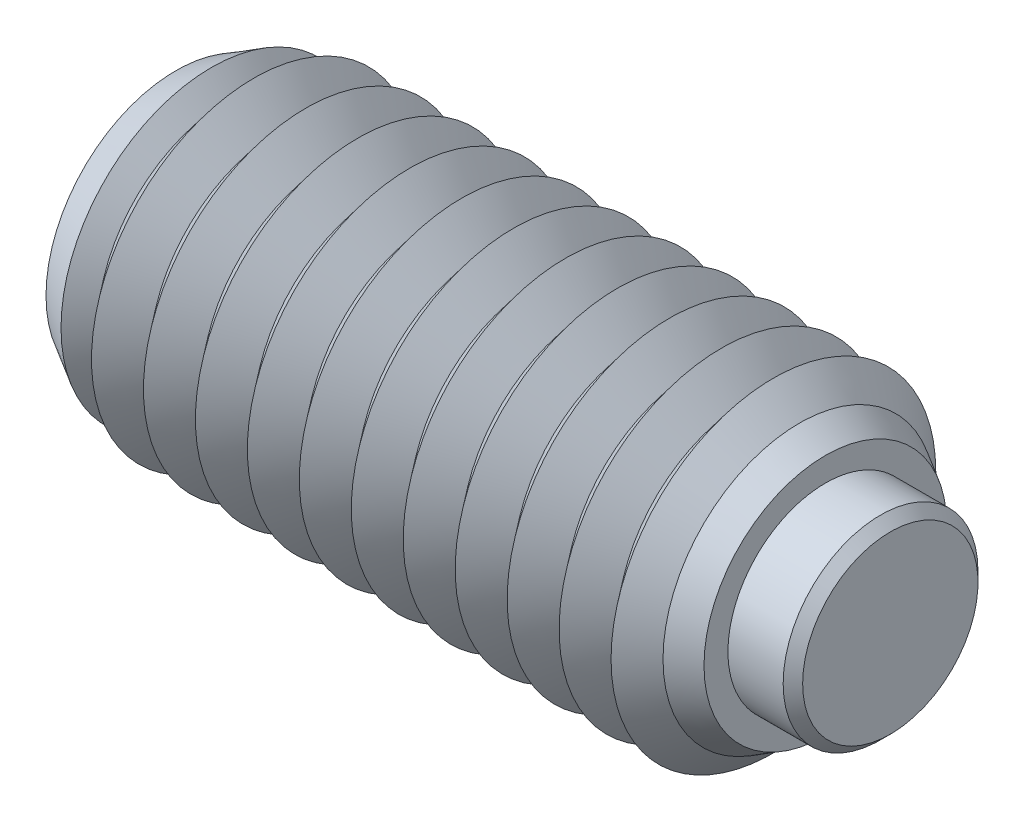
ISO-10303-21;
HEADER;
FILE_DESCRIPTION(('STEP AP214'),'2;1');
FILE_NAME('part.step','',(''),(''),'','','');
FILE_SCHEMA(('AUTOMOTIVE_DESIGN { 1 0 10303 214 1 1 1 1 }'));
ENDSEC;
DATA;
#1=APPLICATION_CONTEXT('core data for automotive mechanical design processes');
#2=APPLICATION_PROTOCOL_DEFINITION('international standard','automotive_design',2000,#1);
#3=PRODUCT_CONTEXT('',#1,'mechanical');
#4=PRODUCT('Part','Part','',(#3));
#5=PRODUCT_RELATED_PRODUCT_CATEGORY('part','',(#4));
#6=PRODUCT_DEFINITION_FORMATION('','',#4);
#7=PRODUCT_DEFINITION_CONTEXT('part definition',#1,'design');
#8=PRODUCT_DEFINITION('design','',#6,#7);
#9=PRODUCT_DEFINITION_SHAPE('','',#8);
#10=(LENGTH_UNIT() NAMED_UNIT(*) SI_UNIT(.MILLI.,.METRE.));
#11=(NAMED_UNIT(*) PLANE_ANGLE_UNIT() SI_UNIT($,.RADIAN.));
#12=(NAMED_UNIT(*) SI_UNIT($,.STERADIAN.) SOLID_ANGLE_UNIT());
#13=UNCERTAINTY_MEASURE_WITH_UNIT(LENGTH_MEASURE(1.E-05),#10,'distance_accuracy_value','');
#14=(GEOMETRIC_REPRESENTATION_CONTEXT(3) GLOBAL_UNCERTAINTY_ASSIGNED_CONTEXT((#13)) GLOBAL_UNIT_ASSIGNED_CONTEXT((#10,
#11,#12)) REPRESENTATION_CONTEXT('',''));
#15=CARTESIAN_POINT('',(0.,0.,0.));
#16=DIRECTION('',(0.,0.,1.));
#17=DIRECTION('',(1.,0.,0.));
#18=AXIS2_PLACEMENT_3D('',#15,#16,#17);
#19=CARTESIAN_POINT('',(1.4,0.,0.));
#20=DIRECTION('',(-1.,0.,0.));
#21=DIRECTION('',(0.,0.,1.));
#22=AXIS2_PLACEMENT_3D('',#19,#20,#21);
#23=CYLINDRICAL_SURFACE('',#22,1.5);
#24=CARTESIAN_POINT('',(1.25,0.,0.));
#25=DIRECTION('',(1.,0.,0.));
#26=DIRECTION('',(0.,0.,-1.));
#27=AXIS2_PLACEMENT_3D('',#24,#25,#26);
#28=CIRCLE('',#27,1.5);
#29=CARTESIAN_POINT('',(1.25,0.,1.5));
#30=VERTEX_POINT('',#29);
#31=EDGE_CURVE('P0_E10',#30,#30,#28,.F.);
#32=ORIENTED_EDGE('',*,*,#31,.T.);
#33=EDGE_LOOP('',(#32));
#34=FACE_BOUND('',#33,.T.);
#35=CARTESIAN_POINT('',(-0.6,0.,0.));
#36=DIRECTION('',(1.,0.,0.));
#37=DIRECTION('',(0.,0.,-1.));
#38=AXIS2_PLACEMENT_3D('',#35,#36,#37);
#39=CIRCLE('',#38,1.5);
#40=CARTESIAN_POINT('',(-0.6,0.,-1.5));
#41=VERTEX_POINT('',#40);
#42=EDGE_CURVE('P0_E25',#41,#41,#39,.T.);
#43=ORIENTED_EDGE('',*,*,#42,.T.);
#44=EDGE_LOOP('',(#43));
#45=FACE_BOUND('',#44,.T.);
#46=ADVANCED_FACE('P0_F14',(#34,#45),#23,.T.);
#47=CARTESIAN_POINT('',(1.4,0.,0.));
#48=DIRECTION('',(1.,0.,0.));
#49=DIRECTION('',(0.,0.,-1.));
#50=AXIS2_PLACEMENT_3D('',#47,#48,#49);
#51=PLANE('',#50);
#52=CARTESIAN_POINT('',(1.4,0.,0.));
#53=DIRECTION('',(1.,0.,0.));
#54=DIRECTION('',(0.,0.,-1.));
#55=AXIS2_PLACEMENT_3D('',#52,#53,#54);
#56=CIRCLE('',#55,1.35);
#57=CARTESIAN_POINT('',(1.4,0.,1.35));
#58=VERTEX_POINT('',#57);
#59=EDGE_CURVE('P0_E21',#58,#58,#56,.T.);
#60=ORIENTED_EDGE('',*,*,#59,.T.);
#61=EDGE_LOOP('',(#60));
#62=FACE_BOUND('',#61,.T.);
#63=ADVANCED_FACE('P0_F35',(#62),#51,.T.);
#64=CARTESIAN_POINT('',(-0.6,0.,0.));
#65=DIRECTION('',(1.,0.,0.));
#66=DIRECTION('',(0.,0.,-1.));
#67=AXIS2_PLACEMENT_3D('',#64,#65,#66);
#68=PLANE('',#67);
#69=ORIENTED_EDGE('',*,*,#42,.F.);
#70=EDGE_LOOP('',(#69));
#71=FACE_BOUND('',#70,.T.);
#72=ADVANCED_FACE('P0_F33',(#71),#68,.F.);
#73=CARTESIAN_POINT('',(1.4,0.,0.));
#74=DIRECTION('',(-1.,0.,0.));
#75=DIRECTION('',(0.,0.,1.));
#76=AXIS2_PLACEMENT_3D('',#73,#74,#75);
#77=CONICAL_SURFACE('',#76,1.35,0.785398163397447);
#78=CARTESIAN_POINT('',(1.25,0.,1.5));
#79=CARTESIAN_POINT('',(1.2515625,0.,1.4984375));
#80=CARTESIAN_POINT('',(1.253125,0.,1.496875));
#81=CARTESIAN_POINT('',(1.25625,0.,1.49375));
#82=CARTESIAN_POINT('',(1.2578125,0.,1.4921875));
#83=CARTESIAN_POINT('',(1.2609375,0.,1.4890625));
#84=CARTESIAN_POINT('',(1.2625,0.,1.4875));
#85=CARTESIAN_POINT('',(1.265625,0.,1.484375));
#86=CARTESIAN_POINT('',(1.2671875,0.,1.4828125));
#87=CARTESIAN_POINT('',(1.2703125,0.,1.4796875));
#88=CARTESIAN_POINT('',(1.271875,0.,1.478125));
#89=CARTESIAN_POINT('',(1.275,0.,1.475));
#90=CARTESIAN_POINT('',(1.2765625,0.,1.4734375));
#91=CARTESIAN_POINT('',(1.2796875,0.,1.4703125));
#92=CARTESIAN_POINT('',(1.28125,0.,1.46875));
#93=CARTESIAN_POINT('',(1.284375,0.,1.465625));
#94=CARTESIAN_POINT('',(1.2859375,0.,1.4640625));
#95=CARTESIAN_POINT('',(1.2890625,0.,1.4609375));
#96=CARTESIAN_POINT('',(1.290625,0.,1.459375));
#97=CARTESIAN_POINT('',(1.29375,0.,1.45625));
#98=CARTESIAN_POINT('',(1.2953125,0.,1.4546875));
#99=CARTESIAN_POINT('',(1.2984375,0.,1.4515625));
#100=CARTESIAN_POINT('',(1.3,0.,1.45));
#101=CARTESIAN_POINT('',(1.303125,0.,1.446875));
#102=CARTESIAN_POINT('',(1.3046875,0.,1.4453125));
#103=CARTESIAN_POINT('',(1.3078125,0.,1.4421875));
#104=CARTESIAN_POINT('',(1.309375,0.,1.440625));
#105=CARTESIAN_POINT('',(1.3125,0.,1.4375));
#106=CARTESIAN_POINT('',(1.3140625,0.,1.4359375));
#107=CARTESIAN_POINT('',(1.3171875,0.,1.4328125));
#108=CARTESIAN_POINT('',(1.31875,0.,1.43125));
#109=CARTESIAN_POINT('',(1.321875,0.,1.428125));
#110=CARTESIAN_POINT('',(1.3234375,0.,1.4265625));
#111=CARTESIAN_POINT('',(1.3265625,0.,1.4234375));
#112=CARTESIAN_POINT('',(1.328125,0.,1.421875));
#113=CARTESIAN_POINT('',(1.33125,0.,1.41875));
#114=CARTESIAN_POINT('',(1.3328125,0.,1.4171875));
#115=CARTESIAN_POINT('',(1.3359375,0.,1.4140625));
#116=CARTESIAN_POINT('',(1.3375,0.,1.4125));
#117=CARTESIAN_POINT('',(1.340625,0.,1.409375));
#118=CARTESIAN_POINT('',(1.3421875,0.,1.4078125));
#119=CARTESIAN_POINT('',(1.3453125,0.,1.4046875));
#120=CARTESIAN_POINT('',(1.346875,0.,1.403125));
#121=CARTESIAN_POINT('',(1.35,0.,1.4));
#122=CARTESIAN_POINT('',(1.3515625,0.,1.3984375));
#123=CARTESIAN_POINT('',(1.3546875,0.,1.3953125));
#124=CARTESIAN_POINT('',(1.35625,0.,1.39375));
#125=CARTESIAN_POINT('',(1.359375,0.,1.390625));
#126=CARTESIAN_POINT('',(1.3609375,0.,1.3890625));
#127=CARTESIAN_POINT('',(1.3640625,0.,1.3859375));
#128=CARTESIAN_POINT('',(1.365625,0.,1.384375));
#129=CARTESIAN_POINT('',(1.36875,0.,1.38125));
#130=CARTESIAN_POINT('',(1.3703125,0.,1.3796875));
#131=CARTESIAN_POINT('',(1.3734375,0.,1.3765625));
#132=CARTESIAN_POINT('',(1.375,0.,1.375));
#133=CARTESIAN_POINT('',(1.378125,0.,1.371875));
#134=CARTESIAN_POINT('',(1.3796875,0.,1.3703125));
#135=CARTESIAN_POINT('',(1.3828125,0.,1.3671875));
#136=CARTESIAN_POINT('',(1.384375,0.,1.365625));
#137=CARTESIAN_POINT('',(1.3875,0.,1.3625));
#138=CARTESIAN_POINT('',(1.3890625,0.,1.3609375));
#139=CARTESIAN_POINT('',(1.3921875,0.,1.3578125));
#140=CARTESIAN_POINT('',(1.39375,0.,1.35625));
#141=CARTESIAN_POINT('',(1.396875,0.,1.353125));
#142=CARTESIAN_POINT('',(1.3984375,0.,1.3515625));
#143=CARTESIAN_POINT('',(1.4,0.,1.35));
#144=B_SPLINE_CURVE_WITH_KNOTS('',3,(#78,#79,#80,#81,#82,#83,#84,#85,#86,#87,#88,#89,#90,#91,
#92,#93,#94,#95,#96,#97,#98,#99,#100,#101,#102,#103,#104,#105,#106,#107,#108,#109,#110,#111,
#112,#113,#114,#115,#116,#117,#118,#119,#120,#121,#122,#123,#124,#125,#126,#127,#128,#129,#130,
#131,#132,#133,#134,#135,#136,#137,#138,#139,#140,#141,#142,#143),.UNSPECIFIED.,.F.,.F.,(4,2,2,
2,2,2,2,2,2,2,2,2,2,2,2,2,2,2,2,2,2,2,2,2,2,2,2,2,2,2,2,2,4),(0.,0.00662912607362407,
0.0132582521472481,0.0198873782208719,0.0265165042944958,0.0331456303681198,0.0397747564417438,
0.0464038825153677,0.0530330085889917,0.0596621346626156,0.0662912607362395,0.0729203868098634,
0.0795495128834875,0.0861786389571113,0.0928077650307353,0.0994368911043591,0.106066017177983,
0.112695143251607,0.119324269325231,0.125953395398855,0.132582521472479,0.139211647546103,
0.145840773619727,0.152469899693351,0.159099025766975,0.165728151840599,0.172357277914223,
0.178986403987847,0.18561553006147,0.192244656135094,0.198873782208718,0.205502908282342,
0.212132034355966),.UNSPECIFIED.);
#145=EDGE_CURVE('P0_BSEAM16',#30,#58,#144,.T.);
#146=ORIENTED_EDGE('',*,*,#31,.F.);
#147=ORIENTED_EDGE('',*,*,#59,.F.);
#148=ORIENTED_EDGE('',*,*,#145,.T.);
#149=ORIENTED_EDGE('',*,*,#145,.F.);
#150=EDGE_LOOP('',(#146,#148,#147,#149));
#151=FACE_BOUND('',#150,.T.);
#152=ADVANCED_FACE('P0_F16',(#151),#77,.T.);
#153=CLOSED_SHELL('',(#46,#63,#72,#152));
#154=MANIFOLD_SOLID_BREP('P0_B1',#153);
#155=CARTESIAN_POINT('',(-9.2,0.,0.));
#156=DIRECTION('',(-1.,0.,0.));
#157=DIRECTION('',(0.,0.,1.));
#158=AXIS2_PLACEMENT_3D('',#155,#156,#157);
#159=CONICAL_SURFACE('',#158,2.5,0.895664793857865);
#160=CARTESIAN_POINT('',(-8.8,0.,0.));
#161=DIRECTION('',(1.,0.,0.));
#162=DIRECTION('',(0.,0.,-1.));
#163=AXIS2_PLACEMENT_3D('',#160,#161,#162);
#164=CIRCLE('',#163,2.00040016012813);
#165=CARTESIAN_POINT('',(-8.8,0.,-2.00040016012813));
#166=VERTEX_POINT('',#165);
#167=EDGE_CURVE('P1_E775',#166,#166,#164,.T.);
#168=ORIENTED_EDGE('',*,*,#167,.F.);
#169=EDGE_LOOP('',(#168));
#170=FACE_BOUND('',#169,.T.);
#171=CARTESIAN_POINT('',(-9.05289799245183,0.,0.));
#172=DIRECTION('',(1.,0.,0.));
#173=DIRECTION('',(0.,0.,-1.));
#174=AXIS2_PLACEMENT_3D('',#171,#172,#173);
#175=CIRCLE('',#174,2.31626965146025);
#176=CARTESIAN_POINT('',(-9.05289799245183,0.,-2.31626965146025));
#177=VERTEX_POINT('',#176);
#178=EDGE_CURVE('P1_E778',#177,#177,#175,.F.);
#179=ORIENTED_EDGE('',*,*,#178,.F.);
#180=EDGE_LOOP('',(#179));
#181=FACE_BOUND('',#180,.T.);
#182=ADVANCED_FACE('P1_F15',(#170,#181),#159,.T.);
#183=CARTESIAN_POINT('',(-0.799999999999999,0.,0.));
#184=DIRECTION('',(1.,0.,0.));
#185=DIRECTION('',(0.,0.,-1.));
#186=AXIS2_PLACEMENT_3D('',#183,#184,#185);
#187=CONICAL_SURFACE('',#186,2.00040016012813,0.895664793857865);
#188=CARTESIAN_POINT('',(-0.399999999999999,0.,0.));
#189=DIRECTION('',(1.,0.,0.));
#190=DIRECTION('',(0.,0.,-1.));
#191=AXIS2_PLACEMENT_3D('',#188,#189,#190);
#192=CIRCLE('',#191,2.5);
#193=CARTESIAN_POINT('',(-0.399999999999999,0.,2.5));
#194=VERTEX_POINT('',#193);
#195=EDGE_CURVE('P1_E711',#194,#194,#192,.T.);
#196=ORIENTED_EDGE('',*,*,#195,.F.);
#197=EDGE_LOOP('',(#196));
#198=FACE_BOUND('',#197,.T.);
#199=CARTESIAN_POINT('',(-0.799999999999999,0.,0.));
#200=DIRECTION('',(1.,0.,0.));
#201=DIRECTION('',(0.,0.,-1.));
#202=AXIS2_PLACEMENT_3D('',#199,#200,#201);
#203=CIRCLE('',#202,2.00040016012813);
#204=CARTESIAN_POINT('',(-0.799999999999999,0.,-2.00040016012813));
#205=VERTEX_POINT('',#204);
#206=EDGE_CURVE('P1_E712',#205,#205,#203,.T.);
#207=ORIENTED_EDGE('',*,*,#206,.T.);
#208=EDGE_LOOP('',(#207));
#209=FACE_BOUND('',#208,.T.);
#210=ADVANCED_FACE('P1_F222',(#198,#209),#187,.T.);
#211=CARTESIAN_POINT('',(-1.2,0.,0.));
#212=DIRECTION('',(-1.,0.,0.));
#213=DIRECTION('',(0.,0.,1.));
#214=AXIS2_PLACEMENT_3D('',#211,#212,#213);
#215=CONICAL_SURFACE('',#214,2.5,0.895664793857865);
#216=ORIENTED_EDGE('',*,*,#206,.F.);
#217=EDGE_LOOP('',(#216));
#218=FACE_BOUND('',#217,.T.);
#219=CARTESIAN_POINT('',(-1.2,0.,0.));
#220=DIRECTION('',(1.,0.,0.));
#221=DIRECTION('',(0.,0.,-1.));
#222=AXIS2_PLACEMENT_3D('',#219,#220,#221);
#223=CIRCLE('',#222,2.5);
#224=CARTESIAN_POINT('',(-1.2,0.,-2.5));
#225=VERTEX_POINT('',#224);
#226=EDGE_CURVE('P1_E716',#225,#225,#223,.T.);
#227=ORIENTED_EDGE('',*,*,#226,.T.);
#228=EDGE_LOOP('',(#227));
#229=FACE_BOUND('',#228,.T.);
#230=ADVANCED_FACE('P1_F227',(#218,#229),#215,.T.);
#231=CARTESIAN_POINT('',(-0.6,0.,0.));
#232=DIRECTION('',(1.,0.,0.));
#233=DIRECTION('',(0.,1.,0.));
#234=AXIS2_PLACEMENT_3D('',#231,#232,#233);
#235=PLANE('',#234);
#236=CARTESIAN_POINT('',(-0.6,0.,0.));
#237=DIRECTION('',(1.,0.,0.));
#238=DIRECTION('',(0.,1.,0.));
#239=AXIS2_PLACEMENT_3D('',#236,#237,#238);
#240=CIRCLE('',#239,1.5);
#241=CARTESIAN_POINT('',(-0.6,1.5,0.));
#242=VERTEX_POINT('',#241);
#243=EDGE_CURVE('P1_E382',#242,#242,#240,.T.);
#244=ORIENTED_EDGE('',*,*,#243,.T.);
#245=EDGE_LOOP('',(#244));
#246=FACE_BOUND('',#245,.T.);
#247=ADVANCED_FACE('P1_F309',(#246),#235,.T.);
#248=CARTESIAN_POINT('',(-0.6,0.,0.));
#249=DIRECTION('',(1.,0.,0.));
#250=DIRECTION('',(0.,1.,0.));
#251=AXIS2_PLACEMENT_3D('',#248,#249,#250);
#252=CYLINDRICAL_SURFACE('',#251,1.5);
#253=ORIENTED_EDGE('',*,*,#243,.F.);
#254=EDGE_LOOP('',(#253));
#255=FACE_BOUND('',#254,.T.);
#256=CARTESIAN_POINT('',(0.4,0.,0.));
#257=DIRECTION('',(1.,0.,0.));
#258=DIRECTION('',(0.,1.,0.));
#259=AXIS2_PLACEMENT_3D('',#256,#257,#258);
#260=CIRCLE('',#259,1.5);
#261=CARTESIAN_POINT('',(0.4,1.5,0.));
#262=VERTEX_POINT('',#261);
#263=EDGE_CURVE('P1_E385',#262,#262,#260,.T.);
#264=ORIENTED_EDGE('',*,*,#263,.T.);
#265=EDGE_LOOP('',(#264));
#266=FACE_BOUND('',#265,.T.);
#267=ADVANCED_FACE('P1_F209',(#255,#266),#252,.F.);
#268=CARTESIAN_POINT('',(0.4,1.86905989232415,0.));
#269=DIRECTION('',(1.,0.,0.));
#270=DIRECTION('',(0.,1.,0.));
#271=AXIS2_PLACEMENT_3D('',#268,#269,#270);
#272=PLANE('',#271);
#273=ORIENTED_EDGE('',*,*,#263,.F.);
#274=EDGE_LOOP('',(#273));
#275=FACE_BOUND('',#274,.T.);
#276=CARTESIAN_POINT('',(0.4,0.,0.));
#277=DIRECTION('',(1.,0.,0.));
#278=DIRECTION('',(0.,1.,0.));
#279=AXIS2_PLACEMENT_3D('',#276,#277,#278);
#280=CIRCLE('',#279,1.86905989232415);
#281=CARTESIAN_POINT('',(0.4,1.86905989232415,0.));
#282=VERTEX_POINT('',#281);
#283=EDGE_CURVE('P1_E121',#282,#282,#280,.T.);
#284=ORIENTED_EDGE('',*,*,#283,.T.);
#285=EDGE_LOOP('',(#284));
#286=FACE_BOUND('',#285,.T.);
#287=ADVANCED_FACE('P1_F206',(#275,#286),#272,.T.);
#288=CARTESIAN_POINT('',(0.4,0.,0.));
#289=DIRECTION('',(-1.,0.,0.));
#290=DIRECTION('',(0.,-1.,0.));
#291=AXIS2_PLACEMENT_3D('',#288,#289,#290);
#292=CONICAL_SURFACE('',#291,1.86905989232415,0.523598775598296);
#293=CARTESIAN_POINT('',(0.,0.,0.));
#294=DIRECTION('',(1.,0.,0.));
#295=DIRECTION('',(0.,0.,-1.));
#296=AXIS2_PLACEMENT_3D('',#293,#294,#295);
#297=CIRCLE('',#296,2.1);
#298=CARTESIAN_POINT('',(0.,0.,2.1));
#299=VERTEX_POINT('',#298);
#300=EDGE_CURVE('P1_E373',#299,#299,#297,.T.);
#301=ORIENTED_EDGE('',*,*,#300,.T.);
#302=EDGE_LOOP('',(#301));
#303=FACE_BOUND('',#302,.T.);
#304=ORIENTED_EDGE('',*,*,#283,.F.);
#305=EDGE_LOOP('',(#304));
#306=FACE_BOUND('',#305,.T.);
#307=ADVANCED_FACE('P1_F203',(#303,#306),#292,.T.);
#308=CARTESIAN_POINT('',(0.,0.,0.));
#309=DIRECTION('',(-1.,0.,0.));
#310=DIRECTION('',(0.,0.,1.));
#311=AXIS2_PLACEMENT_3D('',#308,#309,#310);
#312=CONICAL_SURFACE('',#311,2.1,0.785398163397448);
#313=CARTESIAN_POINT('',(-0.399999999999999,0.,2.5));
#314=CARTESIAN_POINT('',(-0.395833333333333,0.,2.49583333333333));
#315=CARTESIAN_POINT('',(-0.391666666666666,0.,2.49166666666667));
#316=CARTESIAN_POINT('',(-0.383333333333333,0.,2.48333333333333));
#317=CARTESIAN_POINT('',(-0.379166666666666,0.,2.47916666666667));
#318=CARTESIAN_POINT('',(-0.370833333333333,0.,2.47083333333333));
#319=CARTESIAN_POINT('',(-0.366666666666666,0.,2.46666666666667));
#320=CARTESIAN_POINT('',(-0.358333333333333,0.,2.45833333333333));
#321=CARTESIAN_POINT('',(-0.354166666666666,0.,2.45416666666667));
#322=CARTESIAN_POINT('',(-0.345833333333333,0.,2.44583333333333));
#323=CARTESIAN_POINT('',(-0.341666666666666,0.,2.44166666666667));
#324=CARTESIAN_POINT('',(-0.333333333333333,0.,2.43333333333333));
#325=CARTESIAN_POINT('',(-0.329166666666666,0.,2.42916666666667));
#326=CARTESIAN_POINT('',(-0.320833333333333,0.,2.42083333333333));
#327=CARTESIAN_POINT('',(-0.316666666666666,0.,2.41666666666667));
#328=CARTESIAN_POINT('',(-0.308333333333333,0.,2.40833333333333));
#329=CARTESIAN_POINT('',(-0.304166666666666,0.,2.40416666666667));
#330=CARTESIAN_POINT('',(-0.295833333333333,0.,2.39583333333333));
#331=CARTESIAN_POINT('',(-0.291666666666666,0.,2.39166666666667));
#332=CARTESIAN_POINT('',(-0.283333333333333,0.,2.38333333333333));
#333=CARTESIAN_POINT('',(-0.279166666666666,0.,2.37916666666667));
#334=CARTESIAN_POINT('',(-0.270833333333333,0.,2.37083333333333));
#335=CARTESIAN_POINT('',(-0.266666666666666,0.,2.36666666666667));
#336=CARTESIAN_POINT('',(-0.258333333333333,0.,2.35833333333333));
#337=CARTESIAN_POINT('',(-0.254166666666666,0.,2.35416666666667));
#338=CARTESIAN_POINT('',(-0.245833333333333,0.,2.34583333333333));
#339=CARTESIAN_POINT('',(-0.241666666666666,0.,2.34166666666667));
#340=CARTESIAN_POINT('',(-0.233333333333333,0.,2.33333333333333));
#341=CARTESIAN_POINT('',(-0.229166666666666,0.,2.32916666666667));
#342=CARTESIAN_POINT('',(-0.220833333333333,0.,2.32083333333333));
#343=CARTESIAN_POINT('',(-0.216666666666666,0.,2.31666666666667));
#344=CARTESIAN_POINT('',(-0.208333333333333,0.,2.30833333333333));
#345=CARTESIAN_POINT('',(-0.204166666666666,0.,2.30416666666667));
#346=CARTESIAN_POINT('',(-0.195833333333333,0.,2.29583333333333));
#347=CARTESIAN_POINT('',(-0.191666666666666,0.,2.29166666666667));
#348=CARTESIAN_POINT('',(-0.183333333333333,0.,2.28333333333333));
#349=CARTESIAN_POINT('',(-0.179166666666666,0.,2.27916666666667));
#350=CARTESIAN_POINT('',(-0.170833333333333,0.,2.27083333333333));
#351=CARTESIAN_POINT('',(-0.166666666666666,0.,2.26666666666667));
#352=CARTESIAN_POINT('',(-0.158333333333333,0.,2.25833333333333));
#353=CARTESIAN_POINT('',(-0.154166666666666,0.,2.25416666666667));
#354=CARTESIAN_POINT('',(-0.145833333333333,0.,2.24583333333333));
#355=CARTESIAN_POINT('',(-0.141666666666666,0.,2.24166666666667));
#356=CARTESIAN_POINT('',(-0.133333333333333,0.,2.23333333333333));
#357=CARTESIAN_POINT('',(-0.129166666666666,0.,2.22916666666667));
#358=CARTESIAN_POINT('',(-0.120833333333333,0.,2.22083333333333));
#359=CARTESIAN_POINT('',(-0.116666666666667,0.,2.21666666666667));
#360=CARTESIAN_POINT('',(-0.108333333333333,0.,2.20833333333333));
#361=CARTESIAN_POINT('',(-0.104166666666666,0.,2.20416666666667));
#362=CARTESIAN_POINT('',(-0.0958333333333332,0.,2.19583333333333));
#363=CARTESIAN_POINT('',(-0.0916666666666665,0.,2.19166666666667));
#364=CARTESIAN_POINT('',(-0.0833333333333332,0.,2.18333333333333));
#365=CARTESIAN_POINT('',(-0.0791666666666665,0.,2.17916666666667));
#366=CARTESIAN_POINT('',(-0.0708333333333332,0.,2.17083333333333));
#367=CARTESIAN_POINT('',(-0.0666666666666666,0.,2.16666666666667));
#368=CARTESIAN_POINT('',(-0.0583333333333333,0.,2.15833333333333));
#369=CARTESIAN_POINT('',(-0.0541666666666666,0.,2.15416666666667));
#370=CARTESIAN_POINT('',(-0.0458333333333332,0.,2.14583333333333));
#371=CARTESIAN_POINT('',(-0.0416666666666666,0.,2.14166666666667));
#372=CARTESIAN_POINT('',(-0.0333333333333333,0.,2.13333333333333));
#373=CARTESIAN_POINT('',(-0.0291666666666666,0.,2.12916666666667));
#374=CARTESIAN_POINT('',(-0.0208333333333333,0.,2.12083333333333));
#375=CARTESIAN_POINT('',(-0.0166666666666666,0.,2.11666666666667));
#376=CARTESIAN_POINT('',(-0.00833333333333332,0.,2.10833333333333));
#377=CARTESIAN_POINT('',(-0.00416666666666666,0.,2.10416666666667));
#378=CARTESIAN_POINT('',(0.,0.,2.1));
#379=B_SPLINE_CURVE_WITH_KNOTS('',3,(#313,#314,#315,#316,#317,#318,#319,#320,#321,#322,#323,
#324,#325,#326,#327,#328,#329,#330,#331,#332,#333,#334,#335,#336,#337,#338,#339,#340,#341,#342,
#343,#344,#345,#346,#347,#348,#349,#350,#351,#352,#353,#354,#355,#356,#357,#358,#359,#360,#361,
#362,#363,#364,#365,#366,#367,#368,#369,#370,#371,#372,#373,#374,#375,#376,#377,#378),
.UNSPECIFIED.,.F.,.F.,(4,2,2,2,2,2,2,2,2,2,2,2,2,2,2,2,2,2,2,2,2,2,2,2,2,2,2,2,2,2,2,2,4),(0.,
0.0176776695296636,0.0353553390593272,0.0530330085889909,0.0707106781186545,0.0883883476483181,
0.106066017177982,0.123743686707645,0.141421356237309,0.159099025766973,0.176776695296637,
0.1944543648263,0.212132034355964,0.229809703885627,0.247487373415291,0.265165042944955,
0.282842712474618,0.300520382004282,0.318198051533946,0.335875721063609,0.353553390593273,
0.371231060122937,0.3889087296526,0.406586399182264,0.424264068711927,0.441941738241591,
0.459619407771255,0.477297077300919,0.494974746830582,0.512652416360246,0.530330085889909,
0.548007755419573,0.565685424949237),.UNSPECIFIED.);
#380=EDGE_CURVE('P1_BSEAM17',#194,#299,#379,.T.);
#381=ORIENTED_EDGE('',*,*,#195,.T.);
#382=ORIENTED_EDGE('',*,*,#300,.F.);
#383=ORIENTED_EDGE('',*,*,#380,.T.);
#384=ORIENTED_EDGE('',*,*,#380,.F.);
#385=EDGE_LOOP('',(#381,#383,#382,#384));
#386=FACE_BOUND('',#385,.T.);
#387=ADVANCED_FACE('P1_F17',(#386),#312,.T.);
#388=CARTESIAN_POINT('',(-1.6,0.,0.));
#389=DIRECTION('',(1.,0.,0.));
#390=DIRECTION('',(0.,0.,-1.));
#391=AXIS2_PLACEMENT_3D('',#388,#389,#390);
#392=CONICAL_SURFACE('',#391,2.00040016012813,0.895664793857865);
#393=ORIENTED_EDGE('',*,*,#226,.F.);
#394=EDGE_LOOP('',(#393));
#395=FACE_BOUND('',#394,.T.);
#396=CARTESIAN_POINT('',(-1.6,0.,0.));
#397=DIRECTION('',(1.,0.,0.));
#398=DIRECTION('',(0.,0.,-1.));
#399=AXIS2_PLACEMENT_3D('',#396,#397,#398);
#400=CIRCLE('',#399,2.00040016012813);
#401=CARTESIAN_POINT('',(-1.6,0.,-2.00040016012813));
#402=VERTEX_POINT('',#401);
#403=EDGE_CURVE('P1_E721',#402,#402,#400,.T.);
#404=ORIENTED_EDGE('',*,*,#403,.T.);
#405=EDGE_LOOP('',(#404));
#406=FACE_BOUND('',#405,.T.);
#407=ADVANCED_FACE('P1_F303',(#395,#406),#392,.T.);
#408=CARTESIAN_POINT('',(-2.,0.,0.));
#409=DIRECTION('',(-1.,0.,0.));
#410=DIRECTION('',(0.,0.,1.));
#411=AXIS2_PLACEMENT_3D('',#408,#409,#410);
#412=CONICAL_SURFACE('',#411,2.5,0.895664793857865);
#413=ORIENTED_EDGE('',*,*,#403,.F.);
#414=EDGE_LOOP('',(#413));
#415=FACE_BOUND('',#414,.T.);
#416=CARTESIAN_POINT('',(-2.,0.,0.));
#417=DIRECTION('',(1.,0.,0.));
#418=DIRECTION('',(0.,0.,-1.));
#419=AXIS2_PLACEMENT_3D('',#416,#417,#418);
#420=CIRCLE('',#419,2.5);
#421=CARTESIAN_POINT('',(-2.,0.,-2.5));
#422=VERTEX_POINT('',#421);
#423=EDGE_CURVE('P1_E724',#422,#422,#420,.T.);
#424=ORIENTED_EDGE('',*,*,#423,.T.);
#425=EDGE_LOOP('',(#424));
#426=FACE_BOUND('',#425,.T.);
#427=ADVANCED_FACE('P1_F299',(#415,#426),#412,.T.);
#428=CARTESIAN_POINT('',(-2.4,0.,0.));
#429=DIRECTION('',(1.,0.,0.));
#430=DIRECTION('',(0.,0.,-1.));
#431=AXIS2_PLACEMENT_3D('',#428,#429,#430);
#432=CONICAL_SURFACE('',#431,2.00040016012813,0.895664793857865);
#433=ORIENTED_EDGE('',*,*,#423,.F.);
#434=EDGE_LOOP('',(#433));
#435=FACE_BOUND('',#434,.T.);
#436=CARTESIAN_POINT('',(-2.4,0.,0.));
#437=DIRECTION('',(1.,0.,0.));
#438=DIRECTION('',(0.,0.,-1.));
#439=AXIS2_PLACEMENT_3D('',#436,#437,#438);
#440=CIRCLE('',#439,2.00040016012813);
#441=CARTESIAN_POINT('',(-2.4,0.,-2.00040016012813));
#442=VERTEX_POINT('',#441);
#443=EDGE_CURVE('P1_E727',#442,#442,#440,.T.);
#444=ORIENTED_EDGE('',*,*,#443,.T.);
#445=EDGE_LOOP('',(#444));
#446=FACE_BOUND('',#445,.T.);
#447=ADVANCED_FACE('P1_F295',(#435,#446),#432,.T.);
#448=CARTESIAN_POINT('',(-2.8,0.,0.));
#449=DIRECTION('',(-1.,0.,0.));
#450=DIRECTION('',(0.,0.,1.));
#451=AXIS2_PLACEMENT_3D('',#448,#449,#450);
#452=CONICAL_SURFACE('',#451,2.5,0.895664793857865);
#453=ORIENTED_EDGE('',*,*,#443,.F.);
#454=EDGE_LOOP('',(#453));
#455=FACE_BOUND('',#454,.T.);
#456=CARTESIAN_POINT('',(-2.8,0.,0.));
#457=DIRECTION('',(1.,0.,0.));
#458=DIRECTION('',(0.,0.,-1.));
#459=AXIS2_PLACEMENT_3D('',#456,#457,#458);
#460=CIRCLE('',#459,2.5);
#461=CARTESIAN_POINT('',(-2.8,0.,-2.5));
#462=VERTEX_POINT('',#461);
#463=EDGE_CURVE('P1_E730',#462,#462,#460,.T.);
#464=ORIENTED_EDGE('',*,*,#463,.T.);
#465=EDGE_LOOP('',(#464));
#466=FACE_BOUND('',#465,.T.);
#467=ADVANCED_FACE('P1_F291',(#455,#466),#452,.T.);
#468=CARTESIAN_POINT('',(-3.2,0.,0.));
#469=DIRECTION('',(1.,0.,0.));
#470=DIRECTION('',(0.,0.,-1.));
#471=AXIS2_PLACEMENT_3D('',#468,#469,#470);
#472=CONICAL_SURFACE('',#471,2.00040016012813,0.895664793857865);
#473=ORIENTED_EDGE('',*,*,#463,.F.);
#474=EDGE_LOOP('',(#473));
#475=FACE_BOUND('',#474,.T.);
#476=CARTESIAN_POINT('',(-3.2,0.,0.));
#477=DIRECTION('',(1.,0.,0.));
#478=DIRECTION('',(0.,0.,-1.));
#479=AXIS2_PLACEMENT_3D('',#476,#477,#478);
#480=CIRCLE('',#479,2.00040016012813);
#481=CARTESIAN_POINT('',(-3.2,0.,-2.00040016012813));
#482=VERTEX_POINT('',#481);
#483=EDGE_CURVE('P1_E733',#482,#482,#480,.T.);
#484=ORIENTED_EDGE('',*,*,#483,.T.);
#485=EDGE_LOOP('',(#484));
#486=FACE_BOUND('',#485,.T.);
#487=ADVANCED_FACE('P1_F287',(#475,#486),#472,.T.);
#488=CARTESIAN_POINT('',(-3.6,0.,0.));
#489=DIRECTION('',(-1.,0.,0.));
#490=DIRECTION('',(0.,0.,1.));
#491=AXIS2_PLACEMENT_3D('',#488,#489,#490);
#492=CONICAL_SURFACE('',#491,2.5,0.895664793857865);
#493=ORIENTED_EDGE('',*,*,#483,.F.);
#494=EDGE_LOOP('',(#493));
#495=FACE_BOUND('',#494,.T.);
#496=CARTESIAN_POINT('',(-3.6,0.,0.));
#497=DIRECTION('',(1.,0.,0.));
#498=DIRECTION('',(0.,0.,-1.));
#499=AXIS2_PLACEMENT_3D('',#496,#497,#498);
#500=CIRCLE('',#499,2.5);
#501=CARTESIAN_POINT('',(-3.6,0.,-2.5));
#502=VERTEX_POINT('',#501);
#503=EDGE_CURVE('P1_E736',#502,#502,#500,.T.);
#504=ORIENTED_EDGE('',*,*,#503,.T.);
#505=EDGE_LOOP('',(#504));
#506=FACE_BOUND('',#505,.T.);
#507=ADVANCED_FACE('P1_F283',(#495,#506),#492,.T.);
#508=CARTESIAN_POINT('',(-4.,0.,0.));
#509=DIRECTION('',(1.,0.,0.));
#510=DIRECTION('',(0.,0.,-1.));
#511=AXIS2_PLACEMENT_3D('',#508,#509,#510);
#512=CONICAL_SURFACE('',#511,2.00040016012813,0.895664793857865);
#513=ORIENTED_EDGE('',*,*,#503,.F.);
#514=EDGE_LOOP('',(#513));
#515=FACE_BOUND('',#514,.T.);
#516=CARTESIAN_POINT('',(-4.,0.,0.));
#517=DIRECTION('',(1.,0.,0.));
#518=DIRECTION('',(0.,0.,-1.));
#519=AXIS2_PLACEMENT_3D('',#516,#517,#518);
#520=CIRCLE('',#519,2.00040016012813);
#521=CARTESIAN_POINT('',(-4.,0.,-2.00040016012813));
#522=VERTEX_POINT('',#521);
#523=EDGE_CURVE('P1_E739',#522,#522,#520,.T.);
#524=ORIENTED_EDGE('',*,*,#523,.T.);
#525=EDGE_LOOP('',(#524));
#526=FACE_BOUND('',#525,.T.);
#527=ADVANCED_FACE('P1_F279',(#515,#526),#512,.T.);
#528=CARTESIAN_POINT('',(-4.4,0.,0.));
#529=DIRECTION('',(-1.,0.,0.));
#530=DIRECTION('',(0.,0.,1.));
#531=AXIS2_PLACEMENT_3D('',#528,#529,#530);
#532=CONICAL_SURFACE('',#531,2.5,0.895664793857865);
#533=ORIENTED_EDGE('',*,*,#523,.F.);
#534=EDGE_LOOP('',(#533));
#535=FACE_BOUND('',#534,.T.);
#536=CARTESIAN_POINT('',(-4.4,0.,0.));
#537=DIRECTION('',(1.,0.,0.));
#538=DIRECTION('',(0.,0.,-1.));
#539=AXIS2_PLACEMENT_3D('',#536,#537,#538);
#540=CIRCLE('',#539,2.5);
#541=CARTESIAN_POINT('',(-4.4,0.,-2.5));
#542=VERTEX_POINT('',#541);
#543=EDGE_CURVE('P1_E742',#542,#542,#540,.T.);
#544=ORIENTED_EDGE('',*,*,#543,.T.);
#545=EDGE_LOOP('',(#544));
#546=FACE_BOUND('',#545,.T.);
#547=ADVANCED_FACE('P1_F275',(#535,#546),#532,.T.);
#548=CARTESIAN_POINT('',(-4.8,0.,0.));
#549=DIRECTION('',(1.,0.,0.));
#550=DIRECTION('',(0.,0.,-1.));
#551=AXIS2_PLACEMENT_3D('',#548,#549,#550);
#552=CONICAL_SURFACE('',#551,2.00040016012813,0.895664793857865);
#553=ORIENTED_EDGE('',*,*,#543,.F.);
#554=EDGE_LOOP('',(#553));
#555=FACE_BOUND('',#554,.T.);
#556=CARTESIAN_POINT('',(-4.8,0.,0.));
#557=DIRECTION('',(1.,0.,0.));
#558=DIRECTION('',(0.,0.,-1.));
#559=AXIS2_PLACEMENT_3D('',#556,#557,#558);
#560=CIRCLE('',#559,2.00040016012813);
#561=CARTESIAN_POINT('',(-4.8,0.,-2.00040016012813));
#562=VERTEX_POINT('',#561);
#563=EDGE_CURVE('P1_E745',#562,#562,#560,.T.);
#564=ORIENTED_EDGE('',*,*,#563,.T.);
#565=EDGE_LOOP('',(#564));
#566=FACE_BOUND('',#565,.T.);
#567=ADVANCED_FACE('P1_F271',(#555,#566),#552,.T.);
#568=CARTESIAN_POINT('',(-5.2,0.,0.));
#569=DIRECTION('',(-1.,0.,0.));
#570=DIRECTION('',(0.,0.,1.));
#571=AXIS2_PLACEMENT_3D('',#568,#569,#570);
#572=CONICAL_SURFACE('',#571,2.5,0.895664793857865);
#573=ORIENTED_EDGE('',*,*,#563,.F.);
#574=EDGE_LOOP('',(#573));
#575=FACE_BOUND('',#574,.T.);
#576=CARTESIAN_POINT('',(-5.2,0.,0.));
#577=DIRECTION('',(1.,0.,0.));
#578=DIRECTION('',(0.,0.,-1.));
#579=AXIS2_PLACEMENT_3D('',#576,#577,#578);
#580=CIRCLE('',#579,2.5);
#581=CARTESIAN_POINT('',(-5.2,0.,-2.5));
#582=VERTEX_POINT('',#581);
#583=EDGE_CURVE('P1_E748',#582,#582,#580,.T.);
#584=ORIENTED_EDGE('',*,*,#583,.T.);
#585=EDGE_LOOP('',(#584));
#586=FACE_BOUND('',#585,.T.);
#587=ADVANCED_FACE('P1_F267',(#575,#586),#572,.T.);
#588=CARTESIAN_POINT('',(-5.6,0.,0.));
#589=DIRECTION('',(1.,0.,0.));
#590=DIRECTION('',(0.,0.,-1.));
#591=AXIS2_PLACEMENT_3D('',#588,#589,#590);
#592=CONICAL_SURFACE('',#591,2.00040016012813,0.895664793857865);
#593=ORIENTED_EDGE('',*,*,#583,.F.);
#594=EDGE_LOOP('',(#593));
#595=FACE_BOUND('',#594,.T.);
#596=CARTESIAN_POINT('',(-5.6,0.,0.));
#597=DIRECTION('',(1.,0.,0.));
#598=DIRECTION('',(0.,0.,-1.));
#599=AXIS2_PLACEMENT_3D('',#596,#597,#598);
#600=CIRCLE('',#599,2.00040016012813);
#601=CARTESIAN_POINT('',(-5.6,0.,-2.00040016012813));
#602=VERTEX_POINT('',#601);
#603=EDGE_CURVE('P1_E751',#602,#602,#600,.T.);
#604=ORIENTED_EDGE('',*,*,#603,.T.);
#605=EDGE_LOOP('',(#604));
#606=FACE_BOUND('',#605,.T.);
#607=ADVANCED_FACE('P1_F263',(#595,#606),#592,.T.);
#608=CARTESIAN_POINT('',(-6.,0.,0.));
#609=DIRECTION('',(-1.,0.,0.));
#610=DIRECTION('',(0.,0.,1.));
#611=AXIS2_PLACEMENT_3D('',#608,#609,#610);
#612=CONICAL_SURFACE('',#611,2.5,0.895664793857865);
#613=ORIENTED_EDGE('',*,*,#603,.F.);
#614=EDGE_LOOP('',(#613));
#615=FACE_BOUND('',#614,.T.);
#616=CARTESIAN_POINT('',(-6.,0.,0.));
#617=DIRECTION('',(1.,0.,0.));
#618=DIRECTION('',(0.,0.,-1.));
#619=AXIS2_PLACEMENT_3D('',#616,#617,#618);
#620=CIRCLE('',#619,2.5);
#621=CARTESIAN_POINT('',(-6.,0.,-2.5));
#622=VERTEX_POINT('',#621);
#623=EDGE_CURVE('P1_E754',#622,#622,#620,.T.);
#624=ORIENTED_EDGE('',*,*,#623,.T.);
#625=EDGE_LOOP('',(#624));
#626=FACE_BOUND('',#625,.T.);
#627=ADVANCED_FACE('P1_F259',(#615,#626),#612,.T.);
#628=CARTESIAN_POINT('',(-6.4,0.,0.));
#629=DIRECTION('',(1.,0.,0.));
#630=DIRECTION('',(0.,0.,-1.));
#631=AXIS2_PLACEMENT_3D('',#628,#629,#630);
#632=CONICAL_SURFACE('',#631,2.00040016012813,0.895664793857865);
#633=ORIENTED_EDGE('',*,*,#623,.F.);
#634=EDGE_LOOP('',(#633));
#635=FACE_BOUND('',#634,.T.);
#636=CARTESIAN_POINT('',(-6.4,0.,0.));
#637=DIRECTION('',(1.,0.,0.));
#638=DIRECTION('',(0.,0.,-1.));
#639=AXIS2_PLACEMENT_3D('',#636,#637,#638);
#640=CIRCLE('',#639,2.00040016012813);
#641=CARTESIAN_POINT('',(-6.4,0.,-2.00040016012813));
#642=VERTEX_POINT('',#641);
#643=EDGE_CURVE('P1_E757',#642,#642,#640,.T.);
#644=ORIENTED_EDGE('',*,*,#643,.T.);
#645=EDGE_LOOP('',(#644));
#646=FACE_BOUND('',#645,.T.);
#647=ADVANCED_FACE('P1_F255',(#635,#646),#632,.T.);
#648=CARTESIAN_POINT('',(-6.8,0.,0.));
#649=DIRECTION('',(-1.,0.,0.));
#650=DIRECTION('',(0.,0.,1.));
#651=AXIS2_PLACEMENT_3D('',#648,#649,#650);
#652=CONICAL_SURFACE('',#651,2.5,0.895664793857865);
#653=ORIENTED_EDGE('',*,*,#643,.F.);
#654=EDGE_LOOP('',(#653));
#655=FACE_BOUND('',#654,.T.);
#656=CARTESIAN_POINT('',(-6.8,0.,0.));
#657=DIRECTION('',(1.,0.,0.));
#658=DIRECTION('',(0.,0.,-1.));
#659=AXIS2_PLACEMENT_3D('',#656,#657,#658);
#660=CIRCLE('',#659,2.5);
#661=CARTESIAN_POINT('',(-6.8,0.,-2.5));
#662=VERTEX_POINT('',#661);
#663=EDGE_CURVE('P1_E760',#662,#662,#660,.T.);
#664=ORIENTED_EDGE('',*,*,#663,.T.);
#665=EDGE_LOOP('',(#664));
#666=FACE_BOUND('',#665,.T.);
#667=ADVANCED_FACE('P1_F251',(#655,#666),#652,.T.);
#668=CARTESIAN_POINT('',(-7.2,0.,0.));
#669=DIRECTION('',(1.,0.,0.));
#670=DIRECTION('',(0.,0.,-1.));
#671=AXIS2_PLACEMENT_3D('',#668,#669,#670);
#672=CONICAL_SURFACE('',#671,2.00040016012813,0.895664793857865);
#673=ORIENTED_EDGE('',*,*,#663,.F.);
#674=EDGE_LOOP('',(#673));
#675=FACE_BOUND('',#674,.T.);
#676=CARTESIAN_POINT('',(-7.2,0.,0.));
#677=DIRECTION('',(1.,0.,0.));
#678=DIRECTION('',(0.,0.,-1.));
#679=AXIS2_PLACEMENT_3D('',#676,#677,#678);
#680=CIRCLE('',#679,2.00040016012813);
#681=CARTESIAN_POINT('',(-7.2,0.,-2.00040016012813));
#682=VERTEX_POINT('',#681);
#683=EDGE_CURVE('P1_E763',#682,#682,#680,.T.);
#684=ORIENTED_EDGE('',*,*,#683,.T.);
#685=EDGE_LOOP('',(#684));
#686=FACE_BOUND('',#685,.T.);
#687=ADVANCED_FACE('P1_F247',(#675,#686),#672,.T.);
#688=CARTESIAN_POINT('',(-7.6,0.,0.));
#689=DIRECTION('',(-1.,0.,0.));
#690=DIRECTION('',(0.,0.,1.));
#691=AXIS2_PLACEMENT_3D('',#688,#689,#690);
#692=CONICAL_SURFACE('',#691,2.5,0.895664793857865);
#693=ORIENTED_EDGE('',*,*,#683,.F.);
#694=EDGE_LOOP('',(#693));
#695=FACE_BOUND('',#694,.T.);
#696=CARTESIAN_POINT('',(-7.6,0.,0.));
#697=DIRECTION('',(1.,0.,0.));
#698=DIRECTION('',(0.,0.,-1.));
#699=AXIS2_PLACEMENT_3D('',#696,#697,#698);
#700=CIRCLE('',#699,2.5);
#701=CARTESIAN_POINT('',(-7.6,0.,-2.5));
#702=VERTEX_POINT('',#701);
#703=EDGE_CURVE('P1_E766',#702,#702,#700,.T.);
#704=ORIENTED_EDGE('',*,*,#703,.T.);
#705=EDGE_LOOP('',(#704));
#706=FACE_BOUND('',#705,.T.);
#707=ADVANCED_FACE('P1_F243',(#695,#706),#692,.T.);
#708=CARTESIAN_POINT('',(-8.,0.,0.));
#709=DIRECTION('',(1.,0.,0.));
#710=DIRECTION('',(0.,0.,-1.));
#711=AXIS2_PLACEMENT_3D('',#708,#709,#710);
#712=CONICAL_SURFACE('',#711,2.00040016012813,0.895664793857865);
#713=ORIENTED_EDGE('',*,*,#703,.F.);
#714=EDGE_LOOP('',(#713));
#715=FACE_BOUND('',#714,.T.);
#716=CARTESIAN_POINT('',(-8.,0.,0.));
#717=DIRECTION('',(1.,0.,0.));
#718=DIRECTION('',(0.,0.,-1.));
#719=AXIS2_PLACEMENT_3D('',#716,#717,#718);
#720=CIRCLE('',#719,2.00040016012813);
#721=CARTESIAN_POINT('',(-8.,0.,-2.00040016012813));
#722=VERTEX_POINT('',#721);
#723=EDGE_CURVE('P1_E769',#722,#722,#720,.T.);
#724=ORIENTED_EDGE('',*,*,#723,.T.);
#725=EDGE_LOOP('',(#724));
#726=FACE_BOUND('',#725,.T.);
#727=ADVANCED_FACE('P1_F239',(#715,#726),#712,.T.);
#728=CARTESIAN_POINT('',(-8.4,0.,0.));
#729=DIRECTION('',(-1.,0.,0.));
#730=DIRECTION('',(0.,0.,1.));
#731=AXIS2_PLACEMENT_3D('',#728,#729,#730);
#732=CONICAL_SURFACE('',#731,2.5,0.895664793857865);
#733=ORIENTED_EDGE('',*,*,#723,.F.);
#734=EDGE_LOOP('',(#733));
#735=FACE_BOUND('',#734,.T.);
#736=CARTESIAN_POINT('',(-8.4,0.,0.));
#737=DIRECTION('',(1.,0.,0.));
#738=DIRECTION('',(0.,0.,-1.));
#739=AXIS2_PLACEMENT_3D('',#736,#737,#738);
#740=CIRCLE('',#739,2.5);
#741=CARTESIAN_POINT('',(-8.4,0.,-2.5));
#742=VERTEX_POINT('',#741);
#743=EDGE_CURVE('P1_E772',#742,#742,#740,.T.);
#744=ORIENTED_EDGE('',*,*,#743,.T.);
#745=EDGE_LOOP('',(#744));
#746=FACE_BOUND('',#745,.T.);
#747=ADVANCED_FACE('P1_F235',(#735,#746),#732,.T.);
#748=CARTESIAN_POINT('',(-8.8,0.,0.));
#749=DIRECTION('',(1.,0.,0.));
#750=DIRECTION('',(0.,0.,-1.));
#751=AXIS2_PLACEMENT_3D('',#748,#749,#750);
#752=CONICAL_SURFACE('',#751,2.00040016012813,0.895664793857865);
#753=ORIENTED_EDGE('',*,*,#743,.F.);
#754=EDGE_LOOP('',(#753));
#755=FACE_BOUND('',#754,.T.);
#756=ORIENTED_EDGE('',*,*,#167,.T.);
#757=EDGE_LOOP('',(#756));
#758=FACE_BOUND('',#757,.T.);
#759=ADVANCED_FACE('P1_F219',(#755,#758),#752,.T.);
#760=CARTESIAN_POINT('',(-9.6,0.,0.));
#761=DIRECTION('',(1.,0.,0.));
#762=DIRECTION('',(0.,0.,1.));
#763=AXIS2_PLACEMENT_3D('',#760,#761,#762);
#764=CONICAL_SURFACE('',#763,2.00040016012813,0.5235987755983);
#765=CARTESIAN_POINT('',(-9.6,0.,0.));
#766=DIRECTION('',(-1.,0.,0.));
#767=DIRECTION('',(0.,0.,1.));
#768=AXIS2_PLACEMENT_3D('',#765,#766,#767);
#769=CIRCLE('',#768,2.00040016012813);
#770=CARTESIAN_POINT('',(-9.6,0.,2.00040016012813));
#771=VERTEX_POINT('',#770);
#772=EDGE_CURVE('P1_E780',#771,#771,#769,.T.);
#773=ORIENTED_EDGE('',*,*,#772,.F.);
#774=EDGE_LOOP('',(#773));
#775=FACE_BOUND('',#774,.T.);
#776=ORIENTED_EDGE('',*,*,#178,.T.);
#777=EDGE_LOOP('',(#776));
#778=FACE_BOUND('',#777,.T.);
#779=ADVANCED_FACE('P1_F159',(#775,#778),#764,.T.);
#780=CARTESIAN_POINT('',(-9.6,0.,0.));
#781=DIRECTION('',(1.,0.,0.));
#782=DIRECTION('',(0.,0.,-1.));
#783=AXIS2_PLACEMENT_3D('',#780,#781,#782);
#784=PLANE('',#783);
#785=CARTESIAN_POINT('',(-9.6,0.,0.));
#786=DIRECTION('',(1.,0.,0.));
#787=DIRECTION('',(0.,0.,-1.));
#788=AXIS2_PLACEMENT_3D('',#785,#786,#787);
#789=CIRCLE('',#788,1.44337567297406);
#790=CARTESIAN_POINT('',(-9.6,-1.25,-0.72168783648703));
#791=VERTEX_POINT('',#790);
#792=CARTESIAN_POINT('',(-9.6,0.,-1.44337567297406));
#793=VERTEX_POINT('',#792);
#794=EDGE_CURVE('P1_E19',#791,#793,#789,.T.);
#795=ORIENTED_EDGE('',*,*,#794,.T.);
#796=CARTESIAN_POINT('',(-9.6,1.25,-0.721687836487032));
#797=VERTEX_POINT('',#796);
#798=EDGE_CURVE('P1_E10',#793,#797,#789,.T.);
#799=ORIENTED_EDGE('',*,*,#798,.T.);
#800=CARTESIAN_POINT('',(-9.6,1.25,0.721687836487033));
#801=VERTEX_POINT('',#800);
#802=EDGE_CURVE('P1_E24',#797,#801,#789,.T.);
#803=ORIENTED_EDGE('',*,*,#802,.T.);
#804=CARTESIAN_POINT('',(-9.6,0.,0.));
#805=DIRECTION('',(-1.,0.,0.));
#806=DIRECTION('',(0.,0.,1.));
#807=AXIS2_PLACEMENT_3D('',#804,#805,#806);
#808=CIRCLE('',#807,1.44337567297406);
#809=CARTESIAN_POINT('',(-9.6,0.,1.44337567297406));
#810=VERTEX_POINT('',#809);
#811=EDGE_CURVE('P1_E92',#810,#801,#808,.T.);
#812=ORIENTED_EDGE('',*,*,#811,.F.);
#813=CARTESIAN_POINT('',(-9.6,-1.25,0.721687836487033));
#814=VERTEX_POINT('',#813);
#815=EDGE_CURVE('P1_E101',#810,#814,#789,.T.);
#816=ORIENTED_EDGE('',*,*,#815,.T.);
#817=EDGE_CURVE('P1_E107',#814,#791,#789,.T.);
#818=ORIENTED_EDGE('',*,*,#817,.T.);
#819=EDGE_LOOP('',(#795,#799,#803,#812,#816,#818));
#820=FACE_BOUND('',#819,.T.);
#821=ORIENTED_EDGE('',*,*,#772,.T.);
#822=EDGE_LOOP('',(#821));
#823=FACE_BOUND('',#822,.T.);
#824=ADVANCED_FACE('P1_F108',(#820,#823),#784,.F.);
#825=CARTESIAN_POINT('',(-9.6,0.,0.));
#826=DIRECTION('',(-1.,0.,0.));
#827=DIRECTION('',(0.,0.,1.));
#828=AXIS2_PLACEMENT_3D('',#825,#826,#827);
#829=CONICAL_SURFACE('',#828,1.44337567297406,1.0471975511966);
#830=ORIENTED_EDGE('',*,*,#794,.F.);
#831=CARTESIAN_POINT('',(-9.60006667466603,0.000200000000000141,-1.4434911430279));
#832=CARTESIAN_POINT('',(-9.58174591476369,-0.0547333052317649,-1.41177538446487));
#833=CARTESIAN_POINT('',(-9.56508330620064,-0.110140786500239,-1.37978586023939));
#834=CARTESIAN_POINT('',(-9.53599730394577,-0.22191536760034,-1.31525277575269));
#835=CARTESIAN_POINT('',(-9.52358420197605,-0.27828445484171,-1.28270806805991));
#836=CARTESIAN_POINT('',(-9.50425968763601,-0.390323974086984,-1.21802202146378));
#837=CARTESIAN_POINT('',(-9.49721968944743,-0.445977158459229,-1.1858906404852));
#838=CARTESIAN_POINT('',(-9.48881243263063,-0.557545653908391,-1.12147653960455));
#839=CARTESIAN_POINT('',(-9.48743821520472,-0.613460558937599,-1.08919405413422));
#840=CARTESIAN_POINT('',(-9.49028333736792,-0.717957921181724,-1.02886247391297));
#841=CARTESIAN_POINT('',(-9.49380409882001,-0.766555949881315,-1.00080438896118));
#842=CARTESIAN_POINT('',(-9.50496711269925,-0.863435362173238,-0.944871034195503));
#843=CARTESIAN_POINT('',(-9.51261318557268,-0.911716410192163,-0.916995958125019));
#844=CARTESIAN_POINT('',(-9.53172945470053,-1.00879588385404,-0.860947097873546));
#845=CARTESIAN_POINT('',(-9.54328075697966,-1.0575820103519,-0.832780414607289));
#846=CARTESIAN_POINT('',(-9.56949831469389,-1.1544262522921,-0.776867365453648));
#847=CARTESIAN_POINT('',(-9.5841584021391,-1.20248561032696,-0.749120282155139));
#848=CARTESIAN_POINT('',(-9.60006667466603,-1.2502,-0.721572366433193));
#849=B_SPLINE_CURVE_WITH_KNOTS('',3,(#831,#832,#833,#834,#835,#836,#837,#838,#839,#840,#841,
#842,#843,#844,#845,#846,#847,#848),.UNSPECIFIED.,.F.,.F.,(4,2,2,2,2,2,2,2,4),(0.,
0.198150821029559,0.39677819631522,0.590488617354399,0.783961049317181,0.952480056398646,
1.1211553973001,1.2935743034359,1.4656542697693),.UNSPECIFIED.);
#850=EDGE_CURVE('P1_E130',#793,#791,#849,.T.);
#851=ORIENTED_EDGE('',*,*,#850,.F.);
#852=EDGE_LOOP('',(#830,#851));
#853=FACE_BOUND('',#852,.T.);
#854=ADVANCED_FACE('P1_F158',(#853),#829,.F.);
#855=ORIENTED_EDGE('',*,*,#817,.F.);
#856=CARTESIAN_POINT('',(-10.0647941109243,-1.25,-1.86893140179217));
#857=CARTESIAN_POINT('',(-10.0388968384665,-1.25,-1.81495202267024));
#858=CARTESIAN_POINT('',(-10.0132686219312,-1.25,-1.76084125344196));
#859=CARTESIAN_POINT('',(-9.96270276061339,-1.25,-1.65228662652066));
#860=CARTESIAN_POINT('',(-9.9377652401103,-1.25,-1.59784271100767));
#861=CARTESIAN_POINT('',(-9.88859391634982,-1.25,-1.48823931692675));
#862=CARTESIAN_POINT('',(-9.86436529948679,-1.25,-1.43307750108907));
#863=CARTESIAN_POINT('',(-9.81699507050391,-1.25,-1.3222918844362));
#864=CARTESIAN_POINT('',(-9.79385340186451,-1.25,-1.26666810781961));
#865=CARTESIAN_POINT('',(-9.7483546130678,-1.25,-1.15340083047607));
#866=CARTESIAN_POINT('',(-9.7260338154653,-1.25,-1.09574254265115));
#867=CARTESIAN_POINT('',(-9.68325547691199,-1.25,-0.979741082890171));
#868=CARTESIAN_POINT('',(-9.66279816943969,-1.25,-0.921397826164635));
#869=CARTESIAN_POINT('',(-9.60508423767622,-1.25,-0.745435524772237));
#870=CARTESIAN_POINT('',(-9.5713502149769,-1.25,-0.626561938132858));
#871=CARTESIAN_POINT('',(-9.53222040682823,-1.25,-0.445873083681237));
#872=CARTESIAN_POINT('',(-9.52109406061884,-1.25,-0.385304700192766));
#873=CARTESIAN_POINT('',(-9.50342785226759,-1.25,-0.263486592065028));
#874=CARTESIAN_POINT('',(-9.49688768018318,-1.25,-0.202236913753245));
#875=CARTESIAN_POINT('',(-9.48899878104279,-1.25,-0.0801324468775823));
#876=CARTESIAN_POINT('',(-9.48758879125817,-1.25,-0.019281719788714));
#877=CARTESIAN_POINT('',(-9.4899161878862,-1.25,0.102319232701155));
#878=CARTESIAN_POINT('',(-9.49365389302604,-1.25,0.163069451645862));
#879=CARTESIAN_POINT('',(-9.50889802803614,-1.25,0.312961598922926));
#880=CARTESIAN_POINT('',(-9.5232612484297,-1.25,0.401813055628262));
#881=CARTESIAN_POINT('',(-9.56029984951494,-1.25,0.577788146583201));
#882=CARTESIAN_POINT('',(-9.58298524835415,-1.25,0.664909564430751));
#883=CARTESIAN_POINT('',(-9.62173745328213,-1.25,0.795209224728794));
#884=CARTESIAN_POINT('',(-9.63562294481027,-1.25,0.839061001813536));
#885=CARTESIAN_POINT('',(-9.66467841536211,-1.25,0.926308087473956));
#886=CARTESIAN_POINT('',(-9.67984759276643,-1.25,0.969703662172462));
#887=CARTESIAN_POINT('',(-9.71125013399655,-1.25,1.05609633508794));
#888=CARTESIAN_POINT('',(-9.72748330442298,-1.25,1.09909350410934));
#889=CARTESIAN_POINT('',(-9.76083824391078,-1.25,1.1847490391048));
#890=CARTESIAN_POINT('',(-9.77796016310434,-1.25,1.22740734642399));
#891=CARTESIAN_POINT('',(-9.82276142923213,-1.25,1.33629459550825));
#892=CARTESIAN_POINT('',(-9.85096938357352,-1.25,1.40230581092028));
#893=CARTESIAN_POINT('',(-9.90874508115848,-1.25,1.53373213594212));
#894=CARTESIAN_POINT('',(-9.93831292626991,-1.25,1.59914720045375));
#895=CARTESIAN_POINT('',(-10.0285769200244,-1.25,1.79469680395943));
#896=CARTESIAN_POINT('',(-10.0908242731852,-1.25,1.92411390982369));
#897=CARTESIAN_POINT('',(-10.2179296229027,-1.25,2.18184246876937));
#898=CARTESIAN_POINT('',(-10.282790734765,-1.25,2.31015236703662));
#899=CARTESIAN_POINT('',(-10.4141807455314,-1.25,2.56589305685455));
#900=CARTESIAN_POINT('',(-10.4807094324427,-1.25,2.69332395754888));
#901=CARTESIAN_POINT('',(-10.6085820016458,-1.25,2.93557826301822));
#902=CARTESIAN_POINT('',(-10.6698225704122,-1.25,3.05045639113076));
#903=CARTESIAN_POINT('',(-10.7930014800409,-1.25,3.27984311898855));
#904=CARTESIAN_POINT('',(-10.8549398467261,-1.25,3.39435170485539));
#905=CARTESIAN_POINT('',(-10.9791811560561,-1.25,3.62279327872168));
#906=CARTESIAN_POINT('',(-11.041482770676,-1.25,3.73672698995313));
#907=CARTESIAN_POINT('',(-11.1664914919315,-1.25,3.96436406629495));
#908=CARTESIAN_POINT('',(-11.2291985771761,-1.25,4.07806744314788));
#909=CARTESIAN_POINT('',(-11.2920543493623,-1.25,4.19168806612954));
#910=B_SPLINE_CURVE_WITH_KNOTS('',3,(#856,#857,#858,#859,#860,#861,#862,#863,#864,#865,#866,
#867,#868,#869,#870,#871,#872,#873,#874,#875,#876,#877,#878,#879,#880,#881,#882,#883,#884,#885,
#886,#887,#888,#889,#890,#891,#892,#893,#894,#895,#896,#897,#898,#899,#900,#901,#902,#903,#904,
#905,#906,#907,#908,#909),.UNSPECIFIED.,.F.,.F.,(4,2,2,2,2,2,2,2,2,2,2,2,2,2,2,2,2,2,2,2,2,2,2,
2,2,2,4),(0.,0.179612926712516,0.359257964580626,0.53999273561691,0.720718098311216,
0.90616778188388,1.09164066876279,1.4615401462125,1.64614554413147,1.83073846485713,
2.01311967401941,2.19551217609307,2.46497297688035,2.73475922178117,2.87273702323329,
3.01062928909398,3.14849655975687,3.2863871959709,3.50172172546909,3.7170724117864,
4.14784491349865,4.57914698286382,5.0103944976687,5.40093821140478,5.79149642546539,
6.18106124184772,6.57060567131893),.UNSPECIFIED.);
#911=EDGE_CURVE('P1_E128',#791,#814,#910,.T.);
#912=ORIENTED_EDGE('',*,*,#911,.F.);
#913=EDGE_LOOP('',(#855,#912));
#914=FACE_BOUND('',#913,.T.);
#915=ADVANCED_FACE('P1_F217',(#914),#829,.F.);
#916=ORIENTED_EDGE('',*,*,#815,.F.);
#917=CARTESIAN_POINT('',(-9.60006667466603,-1.2502,0.721572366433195));
#918=CARTESIAN_POINT('',(-9.58174591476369,-1.19526669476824,0.75328812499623));
#919=CARTESIAN_POINT('',(-9.56508330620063,-1.13985921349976,0.785277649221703));
#920=CARTESIAN_POINT('',(-9.53599730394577,-1.02808463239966,0.849810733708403));
#921=CARTESIAN_POINT('',(-9.52358420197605,-0.97171554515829,0.882355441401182));
#922=CARTESIAN_POINT('',(-9.50425968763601,-0.859676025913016,0.947041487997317));
#923=CARTESIAN_POINT('',(-9.49721968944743,-0.804022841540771,0.979172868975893));
#924=CARTESIAN_POINT('',(-9.48881243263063,-0.692454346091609,1.04358696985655));
#925=CARTESIAN_POINT('',(-9.48743821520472,-0.6365394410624,1.07586945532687));
#926=CARTESIAN_POINT('',(-9.49028333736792,-0.532042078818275,1.13620103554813));
#927=CARTESIAN_POINT('',(-9.49380409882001,-0.483444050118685,1.16425912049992));
#928=CARTESIAN_POINT('',(-9.50496711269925,-0.386564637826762,1.22019247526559));
#929=CARTESIAN_POINT('',(-9.51261318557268,-0.338283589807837,1.24806755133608));
#930=CARTESIAN_POINT('',(-9.53172945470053,-0.241204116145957,1.30411641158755));
#931=CARTESIAN_POINT('',(-9.54328075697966,-0.192417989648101,1.33228309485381));
#932=CARTESIAN_POINT('',(-9.56949831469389,-0.0955737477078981,1.38819614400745));
#933=CARTESIAN_POINT('',(-9.58415840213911,-0.0475143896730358,1.41594322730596));
#934=CARTESIAN_POINT('',(-9.60006667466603,0.000200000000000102,1.4434911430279));
#935=B_SPLINE_CURVE_WITH_KNOTS('',3,(#917,#918,#919,#920,#921,#922,#923,#924,#925,#926,#927,
#928,#929,#930,#931,#932,#933,#934),.UNSPECIFIED.,.F.,.F.,(4,2,2,2,2,2,2,2,4),(0.,
0.198150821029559,0.39677819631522,0.590488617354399,0.783961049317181,0.952480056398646,
1.1211553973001,1.2935743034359,1.4656542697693),.UNSPECIFIED.);
#936=EDGE_CURVE('P1_E96',#814,#810,#935,.T.);
#937=ORIENTED_EDGE('',*,*,#936,.F.);
#938=EDGE_LOOP('',(#916,#937));
#939=FACE_BOUND('',#938,.T.);
#940=ADVANCED_FACE('P1_F102',(#939),#829,.F.);
#941=ORIENTED_EDGE('',*,*,#811,.T.);
#942=CARTESIAN_POINT('',(-9.60006667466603,-0.000199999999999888,1.4434911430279));
#943=CARTESIAN_POINT('',(-9.58174591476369,0.0547333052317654,1.41177538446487));
#944=CARTESIAN_POINT('',(-9.56508330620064,0.11014078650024,1.37978586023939));
#945=CARTESIAN_POINT('',(-9.53599730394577,0.22191536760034,1.31525277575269));
#946=CARTESIAN_POINT('',(-9.52358420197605,0.27828445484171,1.28270806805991));
#947=CARTESIAN_POINT('',(-9.50425968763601,0.390323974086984,1.21802202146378));
#948=CARTESIAN_POINT('',(-9.49721968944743,0.445977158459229,1.1858906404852));
#949=CARTESIAN_POINT('',(-9.48881243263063,0.557545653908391,1.12147653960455));
#950=CARTESIAN_POINT('',(-9.48743821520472,0.6134605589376,1.08919405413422));
#951=CARTESIAN_POINT('',(-9.49028333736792,0.717957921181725,1.02886247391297));
#952=CARTESIAN_POINT('',(-9.49380409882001,0.766555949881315,1.00080438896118));
#953=CARTESIAN_POINT('',(-9.50496711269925,0.863435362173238,0.944871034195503));
#954=CARTESIAN_POINT('',(-9.51261318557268,0.911716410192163,0.91699595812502));
#955=CARTESIAN_POINT('',(-9.53172945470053,1.00879588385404,0.860947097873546));
#956=CARTESIAN_POINT('',(-9.54328075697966,1.0575820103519,0.83278041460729));
#957=CARTESIAN_POINT('',(-9.56949831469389,1.1544262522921,0.776867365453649));
#958=CARTESIAN_POINT('',(-9.58415840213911,1.20248561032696,0.74912028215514));
#959=CARTESIAN_POINT('',(-9.60006667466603,1.2502,0.721572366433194));
#960=B_SPLINE_CURVE_WITH_KNOTS('',3,(#942,#943,#944,#945,#946,#947,#948,#949,#950,#951,#952,
#953,#954,#955,#956,#957,#958,#959),.UNSPECIFIED.,.F.,.F.,(4,2,2,2,2,2,2,2,4),(0.,
0.198150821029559,0.39677819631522,0.590488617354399,0.783961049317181,0.952480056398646,
1.1211553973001,1.2935743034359,1.4656542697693),.UNSPECIFIED.);
#961=EDGE_CURVE('P1_E88',#810,#801,#960,.T.);
#962=ORIENTED_EDGE('',*,*,#961,.F.);
#963=EDGE_LOOP('',(#941,#962));
#964=FACE_BOUND('',#963,.T.);
#965=ADVANCED_FACE('P1_F90',(#964),#829,.F.);
#966=ORIENTED_EDGE('',*,*,#802,.F.);
#967=CARTESIAN_POINT('',(-10.0647941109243,1.25,-1.86893140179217));
#968=CARTESIAN_POINT('',(-10.0388968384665,1.25,-1.81495202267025));
#969=CARTESIAN_POINT('',(-10.0132686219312,1.25,-1.76084125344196));
#970=CARTESIAN_POINT('',(-9.96270276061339,1.25,-1.65228662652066));
#971=CARTESIAN_POINT('',(-9.93776524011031,1.25,-1.59784271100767));
#972=CARTESIAN_POINT('',(-9.88859391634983,1.25,-1.48823931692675));
#973=CARTESIAN_POINT('',(-9.86436529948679,1.25,-1.43307750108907));
#974=CARTESIAN_POINT('',(-9.81699507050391,1.25,-1.3222918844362));
#975=CARTESIAN_POINT('',(-9.79385340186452,1.25,-1.26666810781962));
#976=CARTESIAN_POINT('',(-9.7483546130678,1.25,-1.15340083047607));
#977=CARTESIAN_POINT('',(-9.7260338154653,1.25,-1.09574254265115));
#978=CARTESIAN_POINT('',(-9.68325547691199,1.25,-0.979741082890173));
#979=CARTESIAN_POINT('',(-9.66279816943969,1.25,-0.921397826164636));
#980=CARTESIAN_POINT('',(-9.60508423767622,1.25,-0.745435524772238));
#981=CARTESIAN_POINT('',(-9.57135021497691,1.25,-0.626561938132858));
#982=CARTESIAN_POINT('',(-9.53222040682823,1.25,-0.445873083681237));
#983=CARTESIAN_POINT('',(-9.52109406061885,1.25,-0.385304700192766));
#984=CARTESIAN_POINT('',(-9.50342785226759,1.25,-0.263486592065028));
#985=CARTESIAN_POINT('',(-9.49688768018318,1.25,-0.202236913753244));
#986=CARTESIAN_POINT('',(-9.48899878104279,1.25,-0.0801324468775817));
#987=CARTESIAN_POINT('',(-9.48758879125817,1.25,-0.0192817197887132));
#988=CARTESIAN_POINT('',(-9.48991618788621,1.25,0.102319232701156));
#989=CARTESIAN_POINT('',(-9.49365389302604,1.25,0.163069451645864));
#990=CARTESIAN_POINT('',(-9.50889802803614,1.25,0.312961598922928));
#991=CARTESIAN_POINT('',(-9.5232612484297,1.25,0.401813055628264));
#992=CARTESIAN_POINT('',(-9.56029984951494,1.25,0.577788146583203));
#993=CARTESIAN_POINT('',(-9.58298524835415,1.25,0.664909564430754));
#994=CARTESIAN_POINT('',(-9.62173745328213,1.25,0.795209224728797));
#995=CARTESIAN_POINT('',(-9.63562294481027,1.25,0.839061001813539));
#996=CARTESIAN_POINT('',(-9.66467841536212,1.25,0.926308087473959));
#997=CARTESIAN_POINT('',(-9.67984759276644,1.25,0.969703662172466));
#998=CARTESIAN_POINT('',(-9.71125013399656,1.25,1.05609633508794));
#999=CARTESIAN_POINT('',(-9.72748330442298,1.25,1.09909350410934));
#1000=CARTESIAN_POINT('',(-9.76083824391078,1.25,1.1847490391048));
#1001=CARTESIAN_POINT('',(-9.77796016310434,1.25,1.227407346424));
#1002=CARTESIAN_POINT('',(-9.82276142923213,1.25,1.33629459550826));
#1003=CARTESIAN_POINT('',(-9.85096938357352,1.25,1.40230581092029));
#1004=CARTESIAN_POINT('',(-9.90874508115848,1.25,1.53373213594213));
#1005=CARTESIAN_POINT('',(-9.93831292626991,1.25,1.59914720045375));
#1006=CARTESIAN_POINT('',(-10.0285769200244,1.25,1.79469680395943));
#1007=CARTESIAN_POINT('',(-10.0908242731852,1.25,1.92411390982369));
#1008=CARTESIAN_POINT('',(-10.2179296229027,1.25,2.18184246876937));
#1009=CARTESIAN_POINT('',(-10.282790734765,1.25,2.31015236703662));
#1010=CARTESIAN_POINT('',(-10.4141807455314,1.25,2.56589305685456));
#1011=CARTESIAN_POINT('',(-10.4807094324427,1.25,2.69332395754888));
#1012=CARTESIAN_POINT('',(-10.6085820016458,1.25,2.93557826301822));
#1013=CARTESIAN_POINT('',(-10.6698225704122,1.25,3.05045639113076));
#1014=CARTESIAN_POINT('',(-10.7930014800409,1.25,3.27984311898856));
#1015=CARTESIAN_POINT('',(-10.8549398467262,1.25,3.39435170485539));
#1016=CARTESIAN_POINT('',(-10.9791811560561,1.25,3.62279327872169));
#1017=CARTESIAN_POINT('',(-11.041482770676,1.25,3.73672698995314));
#1018=CARTESIAN_POINT('',(-11.1664914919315,1.25,3.96436406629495));
#1019=CARTESIAN_POINT('',(-11.2291985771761,1.25,4.07806744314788));
#1020=CARTESIAN_POINT('',(-11.2920543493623,1.25,4.19168806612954));
#1021=B_SPLINE_CURVE_WITH_KNOTS('',3,(#967,#968,#969,#970,#971,#972,#973,#974,#975,#976,#977,
#978,#979,#980,#981,#982,#983,#984,#985,#986,#987,#988,#989,#990,#991,#992,#993,#994,#995,#996,
#997,#998,#999,#1000,#1001,#1002,#1003,#1004,#1005,#1006,#1007,#1008,#1009,#1010,#1011,#1012,
#1013,#1014,#1015,#1016,#1017,#1018,#1019,#1020),.UNSPECIFIED.,.F.,.F.,(4,2,2,2,2,2,2,2,2,2,2,2,
2,2,2,2,2,2,2,2,2,2,2,2,2,2,4),(0.,0.179612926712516,0.359257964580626,0.539992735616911,
0.720718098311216,0.90616778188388,1.09164066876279,1.4615401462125,1.64614554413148,
1.83073846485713,2.01311967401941,2.19551217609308,2.46497297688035,2.73475922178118,
2.8727370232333,3.01062928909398,3.14849655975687,3.2863871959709,3.50172172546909,
3.71707241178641,4.14784491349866,4.57914698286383,5.0103944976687,5.40093821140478,
5.7914964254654,6.18106124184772,6.57060567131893),.UNSPECIFIED.);
#1022=EDGE_CURVE('P1_E97',#801,#797,#1021,.F.);
#1023=ORIENTED_EDGE('',*,*,#1022,.F.);
#1024=EDGE_LOOP('',(#966,#1023));
#1025=FACE_BOUND('',#1024,.T.);
#1026=ADVANCED_FACE('P1_F157',(#1025),#829,.F.);
#1027=ORIENTED_EDGE('',*,*,#798,.F.);
#1028=CARTESIAN_POINT('',(-9.60006667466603,1.2502,-0.721572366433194));
#1029=CARTESIAN_POINT('',(-9.58174591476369,1.19526669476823,-0.753288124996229));
#1030=CARTESIAN_POINT('',(-9.56508330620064,1.13985921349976,-0.785277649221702));
#1031=CARTESIAN_POINT('',(-9.53599730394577,1.02808463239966,-0.849810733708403));
#1032=CARTESIAN_POINT('',(-9.52358420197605,0.971715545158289,-0.882355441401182));
#1033=CARTESIAN_POINT('',(-9.50425968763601,0.859676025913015,-0.947041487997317));
#1034=CARTESIAN_POINT('',(-9.49721968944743,0.80402284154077,-0.979172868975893));
#1035=CARTESIAN_POINT('',(-9.48881243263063,0.692454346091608,-1.04358696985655));
#1036=CARTESIAN_POINT('',(-9.48743821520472,0.636539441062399,-1.07586945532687));
#1037=CARTESIAN_POINT('',(-9.49028333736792,0.532042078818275,-1.13620103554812));
#1038=CARTESIAN_POINT('',(-9.49380409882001,0.483444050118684,-1.16425912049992));
#1039=CARTESIAN_POINT('',(-9.50496711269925,0.386564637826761,-1.22019247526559));
#1040=CARTESIAN_POINT('',(-9.51261318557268,0.338283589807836,-1.24806755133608));
#1041=CARTESIAN_POINT('',(-9.53172945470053,0.241204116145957,-1.30411641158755));
#1042=CARTESIAN_POINT('',(-9.54328075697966,0.192417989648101,-1.33228309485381));
#1043=CARTESIAN_POINT('',(-9.56949831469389,0.0955737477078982,-1.38819614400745));
#1044=CARTESIAN_POINT('',(-9.58415840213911,0.0475143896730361,-1.41594322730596));
#1045=CARTESIAN_POINT('',(-9.60006667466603,-0.000199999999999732,-1.4434911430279));
#1046=B_SPLINE_CURVE_WITH_KNOTS('',3,(#1028,#1029,#1030,#1031,#1032,#1033,#1034,#1035,#1036,
#1037,#1038,#1039,#1040,#1041,#1042,#1043,#1044,#1045),.UNSPECIFIED.,.F.,.F.,(4,2,2,2,2,2,2,2,
4),(0.,0.19815082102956,0.396778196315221,0.5904886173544,0.783961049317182,0.952480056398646,
1.1211553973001,1.2935743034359,1.4656542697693),.UNSPECIFIED.);
#1047=EDGE_CURVE('P1_E178',#797,#793,#1046,.T.);
#1048=ORIENTED_EDGE('',*,*,#1047,.F.);
#1049=EDGE_LOOP('',(#1027,#1048));
#1050=FACE_BOUND('',#1049,.T.);
#1051=ADVANCED_FACE('P1_F152',(#1050),#829,.F.);
#1052=CARTESIAN_POINT('',(-6.37831216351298,0.,0.));
#1053=DIRECTION('',(-1.,0.,0.));
#1054=DIRECTION('',(0.,-1.,0.));
#1055=AXIS2_PLACEMENT_3D('',#1052,#1053,#1054);
#1056=CONICAL_SURFACE('',#1055,0.,1.0471975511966);
#1057=CARTESIAN_POINT('',(-7.1,0.,0.));
#1058=DIRECTION('',(1.,0.,0.));
#1059=DIRECTION('',(0.,1.,0.));
#1060=AXIS2_PLACEMENT_3D('',#1057,#1058,#1059);
#1061=CIRCLE('',#1060,1.25);
#1062=CARTESIAN_POINT('',(-7.1,1.25,0.));
#1063=VERTEX_POINT('',#1062);
#1064=CARTESIAN_POINT('',(-7.1,0.625,1.08253175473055));
#1065=VERTEX_POINT('',#1064);
#1066=EDGE_CURVE('P1_E336',#1063,#1065,#1061,.T.);
#1067=ORIENTED_EDGE('',*,*,#1066,.F.);
#1068=CARTESIAN_POINT('',(-7.1,0.625,-1.08253175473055));
#1069=VERTEX_POINT('',#1068);
#1070=EDGE_CURVE('P1_E375',#1069,#1063,#1061,.T.);
#1071=ORIENTED_EDGE('',*,*,#1070,.F.);
#1072=CARTESIAN_POINT('',(-7.1,-0.625000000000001,-1.08253175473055));
#1073=VERTEX_POINT('',#1072);
#1074=EDGE_CURVE('P1_E378',#1073,#1069,#1061,.T.);
#1075=ORIENTED_EDGE('',*,*,#1074,.F.);
#1076=CARTESIAN_POINT('',(-7.1,-1.25,0.));
#1077=VERTEX_POINT('',#1076);
#1078=EDGE_CURVE('P1_E380',#1077,#1073,#1061,.T.);
#1079=ORIENTED_EDGE('',*,*,#1078,.F.);
#1080=CARTESIAN_POINT('',(-7.1,-0.625000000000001,1.08253175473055));
#1081=VERTEX_POINT('',#1080);
#1082=EDGE_CURVE('P1_E388',#1081,#1077,#1061,.T.);
#1083=ORIENTED_EDGE('',*,*,#1082,.F.);
#1084=EDGE_CURVE('P1_E383',#1065,#1081,#1061,.T.);
#1085=ORIENTED_EDGE('',*,*,#1084,.F.);
#1086=EDGE_LOOP('',(#1067,#1071,#1075,#1079,#1083,#1085));
#1087=FACE_BOUND('',#1086,.T.);
#1088=CARTESIAN_POINT('',(-6.37831216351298,0.,0.));
#1089=VERTEX_POINT('',#1088);
#1090=VERTEX_LOOP('',#1089);
#1091=FACE_BOUND('',#1090,.T.);
#1092=ADVANCED_FACE('P1_F156',(#1087,#1091),#1056,.F.);
#1093=CARTESIAN_POINT('',(-7.1,1.25,0.721687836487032));
#1094=DIRECTION('',(-1.,0.,0.));
#1095=DIRECTION('',(0.,0.,1.));
#1096=AXIS2_PLACEMENT_3D('',#1093,#1094,#1095);
#1097=PLANE('',#1096);
#1098=DIRECTION('',(0.,-0.866025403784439,0.5));
#1099=VECTOR('',#1098,1.);
#1100=CARTESIAN_POINT('',(-7.1,0.,-1.44337567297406));
#1101=LINE('',#1100,#1099);
#1102=CARTESIAN_POINT('',(-7.1,0.,-1.44337567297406));
#1103=VERTEX_POINT('',#1102);
#1104=EDGE_CURVE('P1_E349',#1103,#1073,#1101,.T.);
#1105=ORIENTED_EDGE('',*,*,#1104,.T.);
#1106=ORIENTED_EDGE('',*,*,#1074,.T.);
#1107=DIRECTION('',(0.,-0.866025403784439,-0.5));
#1108=VECTOR('',#1107,1.);
#1109=CARTESIAN_POINT('',(-7.1,1.25,-0.721687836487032));
#1110=LINE('',#1109,#1108);
#1111=EDGE_CURVE('P1_E339',#1069,#1103,#1110,.T.);
#1112=ORIENTED_EDGE('',*,*,#1111,.T.);
#1113=EDGE_LOOP('',(#1105,#1106,#1112));
#1114=FACE_BOUND('',#1113,.T.);
#1115=ADVANCED_FACE('P1_F319',(#1114),#1097,.T.);
#1116=DIRECTION('',(0.,0.,1.));
#1117=VECTOR('',#1116,1.);
#1118=CARTESIAN_POINT('',(-7.1,-1.25,-0.721687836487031));
#1119=LINE('',#1118,#1117);
#1120=CARTESIAN_POINT('',(-7.1,-1.25,-0.721687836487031));
#1121=VERTEX_POINT('',#1120);
#1122=EDGE_CURVE('P1_E353',#1121,#1077,#1119,.T.);
#1123=ORIENTED_EDGE('',*,*,#1122,.T.);
#1124=ORIENTED_EDGE('',*,*,#1078,.T.);
#1125=EDGE_CURVE('P1_E348',#1073,#1121,#1101,.T.);
#1126=ORIENTED_EDGE('',*,*,#1125,.T.);
#1127=EDGE_LOOP('',(#1123,#1124,#1126));
#1128=FACE_BOUND('',#1127,.T.);
#1129=ADVANCED_FACE('P1_F395',(#1128),#1097,.T.);
#1130=DIRECTION('',(0.,0.866025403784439,0.5));
#1131=VECTOR('',#1130,1.);
#1132=CARTESIAN_POINT('',(-7.1,-1.25,0.721687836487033));
#1133=LINE('',#1132,#1131);
#1134=CARTESIAN_POINT('',(-7.1,-1.25,0.721687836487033));
#1135=VERTEX_POINT('',#1134);
#1136=EDGE_CURVE('P1_E357',#1135,#1081,#1133,.T.);
#1137=ORIENTED_EDGE('',*,*,#1136,.T.);
#1138=ORIENTED_EDGE('',*,*,#1082,.T.);
#1139=EDGE_CURVE('P1_E352',#1077,#1135,#1119,.T.);
#1140=ORIENTED_EDGE('',*,*,#1139,.T.);
#1141=EDGE_LOOP('',(#1137,#1138,#1140));
#1142=FACE_BOUND('',#1141,.T.);
#1143=ADVANCED_FACE('P1_F330',(#1142),#1097,.T.);
#1144=DIRECTION('',(0.,0.866025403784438,-0.5));
#1145=VECTOR('',#1144,1.);
#1146=CARTESIAN_POINT('',(-7.1,0.,1.44337567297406));
#1147=LINE('',#1146,#1145);
#1148=CARTESIAN_POINT('',(-7.1,0.,1.44337567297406));
#1149=VERTEX_POINT('',#1148);
#1150=EDGE_CURVE('P1_E118',#1149,#1065,#1147,.T.);
#1151=ORIENTED_EDGE('',*,*,#1150,.T.);
#1152=ORIENTED_EDGE('',*,*,#1084,.T.);
#1153=EDGE_CURVE('P1_E356',#1081,#1149,#1133,.T.);
#1154=ORIENTED_EDGE('',*,*,#1153,.T.);
#1155=EDGE_LOOP('',(#1151,#1152,#1154));
#1156=FACE_BOUND('',#1155,.T.);
#1157=ADVANCED_FACE('P1_F323',(#1156),#1097,.T.);
#1158=DIRECTION('',(0.,0.,-1.));
#1159=VECTOR('',#1158,1.);
#1160=CARTESIAN_POINT('',(-7.1,1.25,0.721687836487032));
#1161=LINE('',#1160,#1159);
#1162=CARTESIAN_POINT('',(-7.1,1.25,0.721687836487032));
#1163=VERTEX_POINT('',#1162);
#1164=EDGE_CURVE('P1_E335',#1163,#1063,#1161,.T.);
#1165=ORIENTED_EDGE('',*,*,#1164,.T.);
#1166=ORIENTED_EDGE('',*,*,#1066,.T.);
#1167=EDGE_CURVE('P1_E337',#1065,#1163,#1147,.T.);
#1168=ORIENTED_EDGE('',*,*,#1167,.T.);
#1169=EDGE_LOOP('',(#1165,#1166,#1168));
#1170=FACE_BOUND('',#1169,.T.);
#1171=ADVANCED_FACE('P1_F321',(#1170),#1097,.T.);
#1172=CARTESIAN_POINT('',(-7.1,1.25,-0.721687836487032));
#1173=VERTEX_POINT('',#1172);
#1174=EDGE_CURVE('P1_E342',#1173,#1069,#1110,.T.);
#1175=ORIENTED_EDGE('',*,*,#1174,.T.);
#1176=ORIENTED_EDGE('',*,*,#1070,.T.);
#1177=EDGE_CURVE('P1_E340',#1063,#1173,#1161,.T.);
#1178=ORIENTED_EDGE('',*,*,#1177,.T.);
#1179=EDGE_LOOP('',(#1175,#1176,#1178));
#1180=FACE_BOUND('',#1179,.T.);
#1181=ADVANCED_FACE('P1_F198',(#1180),#1097,.T.);
#1182=CARTESIAN_POINT('',(-7.1,1.25,0.721687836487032));
#1183=DIRECTION('',(0.,1.,0.));
#1184=DIRECTION('',(0.,0.,1.));
#1185=AXIS2_PLACEMENT_3D('',#1182,#1183,#1184);
#1186=PLANE('',#1185);
#1187=DIRECTION('',(-1.,0.,0.));
#1188=VECTOR('',#1187,1.);
#1189=CARTESIAN_POINT('',(-7.1,1.25,0.721687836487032));
#1190=LINE('',#1189,#1188);
#1191=EDGE_CURVE('P1_E359',#1163,#801,#1190,.T.);
#1192=ORIENTED_EDGE('',*,*,#1191,.T.);
#1193=ORIENTED_EDGE('',*,*,#1022,.T.);
#1194=DIRECTION('',(-1.,0.,0.));
#1195=VECTOR('',#1194,1.);
#1196=CARTESIAN_POINT('',(-7.1,1.25,-0.721687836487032));
#1197=LINE('',#1196,#1195);
#1198=EDGE_CURVE('P1_E368',#1173,#797,#1197,.T.);
#1199=ORIENTED_EDGE('',*,*,#1198,.F.);
#1200=ORIENTED_EDGE('',*,*,#1177,.F.);
#1201=ORIENTED_EDGE('',*,*,#1164,.F.);
#1202=EDGE_LOOP('',(#1192,#1193,#1199,#1200,#1201));
#1203=FACE_BOUND('',#1202,.T.);
#1204=ADVANCED_FACE('P1_F195',(#1203),#1186,.F.);
#1205=CARTESIAN_POINT('',(-7.1,0.,1.44337567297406));
#1206=DIRECTION('',(0.,0.5,0.866025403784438));
#1207=DIRECTION('',(0.,-0.866025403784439,0.5));
#1208=AXIS2_PLACEMENT_3D('',#1205,#1206,#1207);
#1209=PLANE('',#1208);
#1210=DIRECTION('',(-1.,0.,0.));
#1211=VECTOR('',#1210,1.);
#1212=CARTESIAN_POINT('',(-7.1,0.,1.44337567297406));
#1213=LINE('',#1212,#1211);
#1214=EDGE_CURVE('P1_E114',#1149,#810,#1213,.T.);
#1215=ORIENTED_EDGE('',*,*,#1214,.T.);
#1216=ORIENTED_EDGE('',*,*,#961,.T.);
#1217=ORIENTED_EDGE('',*,*,#1191,.F.);
#1218=ORIENTED_EDGE('',*,*,#1167,.F.);
#1219=ORIENTED_EDGE('',*,*,#1150,.F.);
#1220=EDGE_LOOP('',(#1215,#1216,#1217,#1218,#1219));
#1221=FACE_BOUND('',#1220,.T.);
#1222=ADVANCED_FACE('P1_F115',(#1221),#1209,.F.);
#1223=CARTESIAN_POINT('',(-7.1,-1.25,0.721687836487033));
#1224=DIRECTION('',(0.,-0.5,0.866025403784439));
#1225=DIRECTION('',(0.,-0.866025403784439,-0.5));
#1226=AXIS2_PLACEMENT_3D('',#1223,#1224,#1225);
#1227=PLANE('',#1226);
#1228=DIRECTION('',(-1.,0.,0.));
#1229=VECTOR('',#1228,1.);
#1230=CARTESIAN_POINT('',(-7.1,-1.25,0.721687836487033));
#1231=LINE('',#1230,#1229);
#1232=EDGE_CURVE('P1_E122',#1135,#814,#1231,.T.);
#1233=ORIENTED_EDGE('',*,*,#1232,.T.);
#1234=ORIENTED_EDGE('',*,*,#936,.T.);
#1235=ORIENTED_EDGE('',*,*,#1214,.F.);
#1236=ORIENTED_EDGE('',*,*,#1153,.F.);
#1237=ORIENTED_EDGE('',*,*,#1136,.F.);
#1238=EDGE_LOOP('',(#1233,#1234,#1235,#1236,#1237));
#1239=FACE_BOUND('',#1238,.T.);
#1240=ADVANCED_FACE('P1_F124',(#1239),#1227,.F.);
#1241=CARTESIAN_POINT('',(-7.1,-1.25,-0.721687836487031));
#1242=DIRECTION('',(0.,-1.,0.));
#1243=DIRECTION('',(0.,0.,-1.));
#1244=AXIS2_PLACEMENT_3D('',#1241,#1242,#1243);
#1245=PLANE('',#1244);
#1246=DIRECTION('',(-1.,0.,0.));
#1247=VECTOR('',#1246,1.);
#1248=CARTESIAN_POINT('',(-7.1,-1.25,-0.721687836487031));
#1249=LINE('',#1248,#1247);
#1250=EDGE_CURVE('P1_E362',#1121,#791,#1249,.T.);
#1251=ORIENTED_EDGE('',*,*,#1250,.T.);
#1252=ORIENTED_EDGE('',*,*,#911,.T.);
#1253=ORIENTED_EDGE('',*,*,#1232,.F.);
#1254=ORIENTED_EDGE('',*,*,#1139,.F.);
#1255=ORIENTED_EDGE('',*,*,#1122,.F.);
#1256=EDGE_LOOP('',(#1251,#1252,#1253,#1254,#1255));
#1257=FACE_BOUND('',#1256,.T.);
#1258=ADVANCED_FACE('P1_F189',(#1257),#1245,.F.);
#1259=CARTESIAN_POINT('',(-7.1,0.,-1.44337567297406));
#1260=DIRECTION('',(0.,-0.5,-0.866025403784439));
#1261=DIRECTION('',(0.,0.866025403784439,-0.5));
#1262=AXIS2_PLACEMENT_3D('',#1259,#1260,#1261);
#1263=PLANE('',#1262);
#1264=DIRECTION('',(-1.,0.,0.));
#1265=VECTOR('',#1264,1.);
#1266=CARTESIAN_POINT('',(-7.1,0.,-1.44337567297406));
#1267=LINE('',#1266,#1265);
#1268=EDGE_CURVE('P1_E365',#1103,#793,#1267,.T.);
#1269=ORIENTED_EDGE('',*,*,#1268,.T.);
#1270=ORIENTED_EDGE('',*,*,#850,.T.);
#1271=ORIENTED_EDGE('',*,*,#1250,.F.);
#1272=ORIENTED_EDGE('',*,*,#1125,.F.);
#1273=ORIENTED_EDGE('',*,*,#1104,.F.);
#1274=EDGE_LOOP('',(#1269,#1270,#1271,#1272,#1273));
#1275=FACE_BOUND('',#1274,.T.);
#1276=ADVANCED_FACE('P1_F185',(#1275),#1263,.F.);
#1277=CARTESIAN_POINT('',(-7.1,1.25,-0.721687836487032));
#1278=DIRECTION('',(0.,0.5,-0.866025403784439));
#1279=DIRECTION('',(0.,0.866025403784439,0.5));
#1280=AXIS2_PLACEMENT_3D('',#1277,#1278,#1279);
#1281=PLANE('',#1280);
#1282=ORIENTED_EDGE('',*,*,#1198,.T.);
#1283=ORIENTED_EDGE('',*,*,#1047,.T.);
#1284=ORIENTED_EDGE('',*,*,#1268,.F.);
#1285=ORIENTED_EDGE('',*,*,#1111,.F.);
#1286=ORIENTED_EDGE('',*,*,#1174,.F.);
#1287=EDGE_LOOP('',(#1282,#1283,#1284,#1285,#1286));
#1288=FACE_BOUND('',#1287,.T.);
#1289=ADVANCED_FACE('P1_F188',(#1288),#1281,.F.);
#1290=CLOSED_SHELL('',(#182,#210,#230,#247,#267,#287,#307,#387,#407,#427,#447,#467,#487,#507,
#527,#547,#567,#587,#607,#627,#647,#667,#687,#707,#727,#747,#759,#779,#824,#854,#915,#940,#965,
#1026,#1051,#1092,#1115,#1129,#1143,#1157,#1171,#1181,#1204,#1222,#1240,#1258,#1276,#1289));
#1291=MANIFOLD_SOLID_BREP('P1_B1',#1290);
#1292=ADVANCED_BREP_SHAPE_REPRESENTATION('',(#18,#154,#1291),#14);
#1293=SHAPE_DEFINITION_REPRESENTATION(#9,#1292);
ENDSEC;
END-ISO-10303-21;
